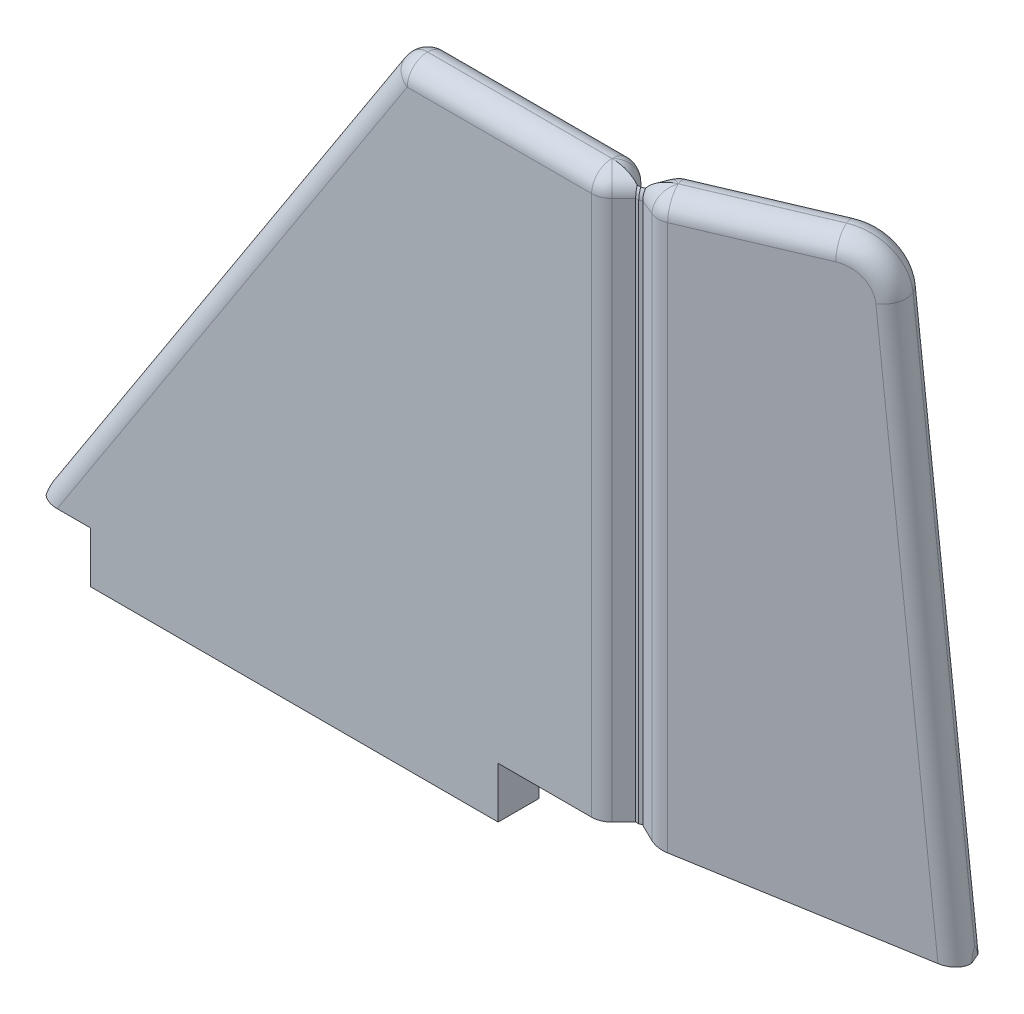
ISO-10303-21;
HEADER;
FILE_DESCRIPTION(('STEP AP214'),'2;1');
FILE_NAME('part.step','',(''),(''),'','','');
FILE_SCHEMA(('AUTOMOTIVE_DESIGN { 1 0 10303 214 1 1 1 1 }'));
ENDSEC;
DATA;
#1=APPLICATION_CONTEXT('core data for automotive mechanical design processes');
#2=APPLICATION_PROTOCOL_DEFINITION('international standard','automotive_design',2000,#1);
#3=PRODUCT_CONTEXT('',#1,'mechanical');
#4=PRODUCT('Part','Part','',(#3));
#5=PRODUCT_RELATED_PRODUCT_CATEGORY('part','',(#4));
#6=PRODUCT_DEFINITION_FORMATION('','',#4);
#7=PRODUCT_DEFINITION_CONTEXT('part definition',#1,'design');
#8=PRODUCT_DEFINITION('design','',#6,#7);
#9=PRODUCT_DEFINITION_SHAPE('','',#8);
#10=(LENGTH_UNIT() NAMED_UNIT(*) SI_UNIT(.MILLI.,.METRE.));
#11=(NAMED_UNIT(*) PLANE_ANGLE_UNIT() SI_UNIT($,.RADIAN.));
#12=(NAMED_UNIT(*) SI_UNIT($,.STERADIAN.) SOLID_ANGLE_UNIT());
#13=UNCERTAINTY_MEASURE_WITH_UNIT(LENGTH_MEASURE(1.E-05),#10,'distance_accuracy_value','');
#14=(GEOMETRIC_REPRESENTATION_CONTEXT(3) GLOBAL_UNCERTAINTY_ASSIGNED_CONTEXT((#13)) GLOBAL_UNIT_ASSIGNED_CONTEXT((#10,
#11,#12)) REPRESENTATION_CONTEXT('',''));
#15=CARTESIAN_POINT('',(0.,0.,0.));
#16=DIRECTION('',(0.,0.,1.));
#17=DIRECTION('',(1.,0.,0.));
#18=AXIS2_PLACEMENT_3D('',#15,#16,#17);
#19=CARTESIAN_POINT('',(22.9149385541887,60.,-9.998404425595));
#20=DIRECTION('',(0.,-1.,0.));
#21=DIRECTION('',(0.,0.,-1.));
#22=AXIS2_PLACEMENT_3D('',#19,#20,#21);
#23=PLANE('',#22);
#24=DIRECTION('',(1.,0.,0.));
#25=VECTOR('',#24,1.);
#26=CARTESIAN_POINT('',(22.9149385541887,60.,0.00999999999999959));
#27=LINE('',#26,#25);
#28=CARTESIAN_POINT('',(-20.9183759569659,60.,0.0100000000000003));
#29=VERTEX_POINT('',#28);
#30=CARTESIAN_POINT('',(-2.82428498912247,60.,0.01));
#31=VERTEX_POINT('',#30);
#32=EDGE_CURVE('E562',#29,#31,#27,.T.);
#33=ORIENTED_EDGE('',*,*,#32,.T.);
#34=DIRECTION('',(0.707106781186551,0.,-0.707106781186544));
#35=VECTOR('',#34,1.);
#36=CARTESIAN_POINT('',(15.0495289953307,60.,-17.863813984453));
#37=LINE('',#36,#35);
#38=CARTESIAN_POINT('',(-2.81428498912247,60.,0.));
#39=VERTEX_POINT('',#38);
#40=EDGE_CURVE('E564',#31,#39,#37,.T.);
#41=ORIENTED_EDGE('',*,*,#40,.T.);
#42=DIRECTION('',(-0.707106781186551,0.,-0.707106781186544));
#43=VECTOR('',#42,1.);
#44=CARTESIAN_POINT('',(5.05112456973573,60.,7.86540955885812));
#45=LINE('',#44,#43);
#46=CARTESIAN_POINT('',(-2.82428498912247,60.,-0.00999999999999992));
#47=VERTEX_POINT('',#46);
#48=EDGE_CURVE('E556',#39,#47,#45,.T.);
#49=ORIENTED_EDGE('',*,*,#48,.T.);
#50=DIRECTION('',(-1.,0.,0.));
#51=VECTOR('',#50,1.);
#52=CARTESIAN_POINT('',(22.9149385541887,60.,-0.00999999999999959));
#53=LINE('',#52,#51);
#54=CARTESIAN_POINT('',(-20.9183759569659,60.,-0.0100000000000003));
#55=VERTEX_POINT('',#54);
#56=EDGE_CURVE('E558',#47,#55,#53,.T.);
#57=ORIENTED_EDGE('',*,*,#56,.T.);
#58=DIRECTION('',(0.,0.,1.));
#59=VECTOR('',#58,1.);
#60=CARTESIAN_POINT('',(-20.9183759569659,60.,-9.998404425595));
#61=LINE('',#60,#59);
#62=EDGE_CURVE('E560',#55,#29,#61,.T.);
#63=ORIENTED_EDGE('',*,*,#62,.T.);
#64=EDGE_LOOP('',(#33,#41,#49,#57,#63));
#65=FACE_BOUND('',#64,.T.);
#66=ADVANCED_FACE('F36',(#65),#23,.F.);
#67=CARTESIAN_POINT('',(22.9149385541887,0.,-9.998404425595));
#68=DIRECTION('',(0.,-1.,0.));
#69=DIRECTION('',(0.,0.,-1.));
#70=AXIS2_PLACEMENT_3D('',#67,#68,#69);
#71=PLANE('',#70);
#72=DIRECTION('',(0.,0.,1.));
#73=VECTOR('',#72,1.);
#74=CARTESIAN_POINT('',(-52.,0.,-2.));
#75=LINE('',#74,#73);
#76=CARTESIAN_POINT('',(-52.,0.,-2.));
#77=VERTEX_POINT('',#76);
#78=CARTESIAN_POINT('',(-52.,0.,2.));
#79=VERTEX_POINT('',#78);
#80=EDGE_CURVE('E435',#77,#79,#75,.T.);
#81=ORIENTED_EDGE('',*,*,#80,.F.);
#82=DIRECTION('',(-1.,0.,0.));
#83=VECTOR('',#82,1.);
#84=CARTESIAN_POINT('',(-57.,0.,-2.));
#85=LINE('',#84,#83);
#86=CARTESIAN_POINT('',(-12.,0.,-2.));
#87=VERTEX_POINT('',#86);
#88=EDGE_CURVE('E482',#87,#77,#85,.T.);
#89=ORIENTED_EDGE('',*,*,#88,.F.);
#90=DIRECTION('',(0.,0.,1.));
#91=VECTOR('',#90,1.);
#92=CARTESIAN_POINT('',(-12.,0.,-2.));
#93=LINE('',#92,#91);
#94=CARTESIAN_POINT('',(-12.,0.,2.));
#95=VERTEX_POINT('',#94);
#96=EDGE_CURVE('E448',#87,#95,#93,.T.);
#97=ORIENTED_EDGE('',*,*,#96,.T.);
#98=DIRECTION('',(1.,0.,0.));
#99=VECTOR('',#98,1.);
#100=CARTESIAN_POINT('',(-2.00000000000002,0.,2.));
#101=LINE('',#100,#99);
#102=EDGE_CURVE('E485',#79,#95,#101,.T.);
#103=ORIENTED_EDGE('',*,*,#102,.F.);
#104=EDGE_LOOP('',(#81,#89,#97,#103));
#105=FACE_BOUND('',#104,.T.);
#106=ADVANCED_FACE('F701',(#105),#71,.T.);
#107=CARTESIAN_POINT('',(-0.0508630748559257,60.,-0.25));
#108=DIRECTION('',(0.390731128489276,0.,0.92050485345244));
#109=DIRECTION('',(0.92050485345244,0.,-0.390731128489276));
#110=AXIS2_PLACEMENT_3D('',#107,#108,#109);
#111=PLANE('',#110);
#112=DIRECTION('',(0.,-1.,0.));
#113=VECTOR('',#112,1.);
#114=CARTESIAN_POINT('',(-0.0508630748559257,60.,-0.25));
#115=LINE('',#114,#113);
#116=CARTESIAN_POINT('',(-0.0508630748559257,58.01,-0.25));
#117=VERTEX_POINT('',#116);
#118=CARTESIAN_POINT('',(-0.0508630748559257,5.,-0.25));
#119=VERTEX_POINT('',#118);
#120=EDGE_CURVE('E500',#117,#119,#115,.T.);
#121=ORIENTED_EDGE('',*,*,#120,.F.);
#122=DIRECTION('',(-0.92050485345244,0.,0.390731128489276));
#123=VECTOR('',#122,1.);
#124=CARTESIAN_POINT('',(-0.0508630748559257,58.01,-0.25));
#125=LINE('',#124,#123);
#126=CARTESIAN_POINT('',(0.132443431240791,58.01,-0.327808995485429));
#127=VERTEX_POINT('',#126);
#128=EDGE_CURVE('E309',#117,#127,#125,.F.);
#129=ORIENTED_EDGE('',*,*,#128,.T.);
#130=DIRECTION('',(0.,-1.,0.));
#131=VECTOR('',#130,1.);
#132=CARTESIAN_POINT('',(0.132443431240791,60.,-0.327808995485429));
#133=LINE('',#132,#131);
#134=CARTESIAN_POINT('',(0.132443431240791,5.,-0.32780899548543));
#135=VERTEX_POINT('',#134);
#136=EDGE_CURVE('E293',#127,#135,#133,.T.);
#137=ORIENTED_EDGE('',*,*,#136,.T.);
#138=DIRECTION('',(-0.92050485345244,0.,0.390731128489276));
#139=VECTOR('',#138,1.);
#140=CARTESIAN_POINT('',(-0.0508630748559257,5.,-0.25));
#141=LINE('',#140,#139);
#142=EDGE_CURVE('E465',#135,#119,#141,.T.);
#143=ORIENTED_EDGE('',*,*,#142,.T.);
#144=EDGE_LOOP('',(#121,#129,#137,#143));
#145=FACE_BOUND('',#144,.T.);
#146=ADVANCED_FACE('F674',(#145),#111,.F.);
#147=CARTESIAN_POINT('',(-0.25,60.,-0.25));
#148=DIRECTION('',(0.,0.,1.));
#149=DIRECTION('',(1.,0.,0.));
#150=AXIS2_PLACEMENT_3D('',#147,#148,#149);
#151=PLANE('',#150);
#152=DIRECTION('',(0.,-1.,0.));
#153=VECTOR('',#152,1.);
#154=CARTESIAN_POINT('',(-0.25,60.,-0.25));
#155=LINE('',#154,#153);
#156=CARTESIAN_POINT('',(-0.25,58.01,-0.25));
#157=VERTEX_POINT('',#156);
#158=CARTESIAN_POINT('',(-0.25,5.,-0.25));
#159=VERTEX_POINT('',#158);
#160=EDGE_CURVE('E498',#157,#159,#155,.T.);
#161=ORIENTED_EDGE('',*,*,#160,.F.);
#162=DIRECTION('',(-1.,0.,0.));
#163=VECTOR('',#162,1.);
#164=CARTESIAN_POINT('',(-0.25,58.01,-0.25));
#165=LINE('',#164,#163);
#166=EDGE_CURVE('E601',#157,#117,#165,.F.);
#167=ORIENTED_EDGE('',*,*,#166,.T.);
#168=ORIENTED_EDGE('',*,*,#120,.T.);
#169=DIRECTION('',(-1.,0.,0.));
#170=VECTOR('',#169,1.);
#171=CARTESIAN_POINT('',(-0.25,5.,-0.25));
#172=LINE('',#171,#170);
#173=EDGE_CURVE('E468',#119,#159,#172,.T.);
#174=ORIENTED_EDGE('',*,*,#173,.T.);
#175=EDGE_LOOP('',(#161,#167,#168,#174));
#176=FACE_BOUND('',#175,.T.);
#177=ADVANCED_FACE('F758',(#176),#151,.F.);
#178=CARTESIAN_POINT('',(-0.25,60.,-0.25));
#179=DIRECTION('',(-0.707106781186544,0.,0.707106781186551));
#180=DIRECTION('',(0.707106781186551,0.,0.707106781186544));
#181=AXIS2_PLACEMENT_3D('',#178,#179,#180);
#182=PLANE('',#181);
#183=DIRECTION('',(0.,-1.,0.));
#184=VECTOR('',#183,1.);
#185=CARTESIAN_POINT('',(-1.41714249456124,60.,-1.41714249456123));
#186=LINE('',#185,#184);
#187=CARTESIAN_POINT('',(-1.41714249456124,5.,-1.41714249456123));
#188=VERTEX_POINT('',#187);
#189=CARTESIAN_POINT('',(-1.41714249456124,58.01,-1.41714249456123));
#190=VERTEX_POINT('',#189);
#191=EDGE_CURVE('E597',#188,#190,#186,.F.);
#192=ORIENTED_EDGE('',*,*,#191,.T.);
#193=DIRECTION('',(-0.707106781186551,0.,-0.707106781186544));
#194=VECTOR('',#193,1.);
#195=CARTESIAN_POINT('',(-0.25,58.01,-0.25));
#196=LINE('',#195,#194);
#197=EDGE_CURVE('E599',#190,#157,#196,.F.);
#198=ORIENTED_EDGE('',*,*,#197,.T.);
#199=ORIENTED_EDGE('',*,*,#160,.T.);
#200=DIRECTION('',(-0.707106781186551,0.,-0.707106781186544));
#201=VECTOR('',#200,1.);
#202=CARTESIAN_POINT('',(-0.25,5.,-0.25));
#203=LINE('',#202,#201);
#204=EDGE_CURVE('E471',#159,#188,#203,.T.);
#205=ORIENTED_EDGE('',*,*,#204,.T.);
#206=EDGE_LOOP('',(#192,#198,#199,#205));
#207=FACE_BOUND('',#206,.T.);
#208=ADVANCED_FACE('F754',(#207),#182,.F.);
#209=CARTESIAN_POINT('',(-57.,60.,-2.));
#210=DIRECTION('',(0.,0.,1.));
#211=DIRECTION('',(1.,0.,0.));
#212=AXIS2_PLACEMENT_3D('',#209,#210,#211);
#213=PLANE('',#212);
#214=DIRECTION('',(-1.,0.,0.));
#215=VECTOR('',#214,1.);
#216=CARTESIAN_POINT('',(-57.,58.01,-2.));
#217=LINE('',#216,#215);
#218=CARTESIAN_POINT('',(-20.9183759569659,58.01,-2.));
#219=VERTEX_POINT('',#218);
#220=CARTESIAN_POINT('',(-2.82428498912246,58.01,-2.));
#221=VERTEX_POINT('',#220);
#222=EDGE_CURVE('E593',#219,#221,#217,.F.);
#223=ORIENTED_EDGE('',*,*,#222,.T.);
#224=DIRECTION('',(0.,-1.,0.));
#225=VECTOR('',#224,1.);
#226=CARTESIAN_POINT('',(-2.82428498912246,60.,-2.));
#227=LINE('',#226,#225);
#228=CARTESIAN_POINT('',(-2.82428498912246,5.,-2.));
#229=VERTEX_POINT('',#228);
#230=EDGE_CURVE('E595',#221,#229,#227,.T.);
#231=ORIENTED_EDGE('',*,*,#230,.T.);
#232=DIRECTION('',(-1.,0.,0.));
#233=VECTOR('',#232,1.);
#234=CARTESIAN_POINT('',(-12.,5.,-2.));
#235=LINE('',#234,#233);
#236=CARTESIAN_POINT('',(-12.,5.,-2.));
#237=VERTEX_POINT('',#236);
#238=EDGE_CURVE('E445',#229,#237,#235,.T.);
#239=ORIENTED_EDGE('',*,*,#238,.T.);
#240=DIRECTION('',(0.,-1.,0.));
#241=VECTOR('',#240,1.);
#242=CARTESIAN_POINT('',(-12.,0.,-2.));
#243=LINE('',#242,#241);
#244=EDGE_CURVE('E442',#237,#87,#243,.T.);
#245=ORIENTED_EDGE('',*,*,#244,.T.);
#246=ORIENTED_EDGE('',*,*,#88,.T.);
#247=DIRECTION('',(0.,1.,0.));
#248=VECTOR('',#247,1.);
#249=CARTESIAN_POINT('',(-52.,0.,-2.));
#250=LINE('',#249,#248);
#251=CARTESIAN_POINT('',(-52.,5.,-2.));
#252=VERTEX_POINT('',#251);
#253=EDGE_CURVE('E425',#77,#252,#250,.T.);
#254=ORIENTED_EDGE('',*,*,#253,.T.);
#255=DIRECTION('',(-1.,0.,0.));
#256=VECTOR('',#255,1.);
#257=CARTESIAN_POINT('',(-52.,5.,-2.));
#258=LINE('',#257,#256);
#259=CARTESIAN_POINT('',(-55.2767092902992,5.,-2.));
#260=VERTEX_POINT('',#259);
#261=EDGE_CURVE('E428',#252,#260,#258,.T.);
#262=ORIENTED_EDGE('',*,*,#261,.T.);
#263=DIRECTION('',(0.543895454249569,0.839152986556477,0.));
#264=VECTOR('',#263,1.);
#265=CARTESIAN_POINT('',(-30.6838648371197,42.9432457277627,-2.));
#266=LINE('',#265,#264);
#267=EDGE_CURVE('E591',#260,#219,#266,.T.);
#268=ORIENTED_EDGE('',*,*,#267,.T.);
#269=EDGE_LOOP('',(#223,#231,#239,#245,#246,#254,#262,#268));
#270=FACE_BOUND('',#269,.T.);
#271=ADVANCED_FACE('F750',(#270),#213,.F.);
#272=CARTESIAN_POINT('',(-57.,60.,2.));
#273=DIRECTION('',(1.,0.,0.));
#274=DIRECTION('',(0.,0.,-1.));
#275=AXIS2_PLACEMENT_3D('',#272,#273,#274);
#276=PLANE('',#275);
#277=DIRECTION('',(0.,0.,1.));
#278=VECTOR('',#277,1.);
#279=CARTESIAN_POINT('',(-57.,6.,-2.));
#280=LINE('',#279,#278);
#281=CARTESIAN_POINT('',(-57.,6.,-0.0100000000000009));
#282=VERTEX_POINT('',#281);
#283=CARTESIAN_POINT('',(-57.,6.,0.0100000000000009));
#284=VERTEX_POINT('',#283);
#285=EDGE_CURVE('E421',#282,#284,#280,.T.);
#286=ORIENTED_EDGE('',*,*,#285,.F.);
#287=CARTESIAN_POINT('',(-57.,2.34120861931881,-0.0100000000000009));
#288=DIRECTION('',(1.,0.,0.));
#289=DIRECTION('',(0.,1.,0.));
#290=AXIS2_PLACEMENT_3D('',#287,#288,#289);
#291=ELLIPSE('',#290,3.65879138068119,1.99);
#292=CARTESIAN_POINT('',(-57.,5.,-1.37707046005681));
#293=VERTEX_POINT('',#292);
#294=EDGE_CURVE('E609',#282,#293,#291,.F.);
#295=ORIENTED_EDGE('',*,*,#294,.T.);
#296=DIRECTION('',(0.,0.,1.));
#297=VECTOR('',#296,1.);
#298=CARTESIAN_POINT('',(-57.,5.,-2.));
#299=LINE('',#298,#297);
#300=CARTESIAN_POINT('',(-57.,5.,1.37707046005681));
#301=VERTEX_POINT('',#300);
#302=EDGE_CURVE('E438',#293,#301,#299,.T.);
#303=ORIENTED_EDGE('',*,*,#302,.T.);
#304=CARTESIAN_POINT('',(-57.,2.34120861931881,0.0100000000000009));
#305=DIRECTION('',(1.,0.,0.));
#306=DIRECTION('',(0.,1.,0.));
#307=AXIS2_PLACEMENT_3D('',#304,#305,#306);
#308=ELLIPSE('',#307,3.65879138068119,1.99);
#309=EDGE_CURVE('E607',#301,#284,#308,.F.);
#310=ORIENTED_EDGE('',*,*,#309,.T.);
#311=EDGE_LOOP('',(#286,#295,#303,#310));
#312=FACE_BOUND('',#311,.T.);
#313=ADVANCED_FACE('F746',(#312),#276,.F.);
#314=CARTESIAN_POINT('',(-2.00000000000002,60.,2.));
#315=DIRECTION('',(0.,0.,-1.));
#316=DIRECTION('',(-1.,0.,0.));
#317=AXIS2_PLACEMENT_3D('',#314,#315,#316);
#318=PLANE('',#317);
#319=DIRECTION('',(-1.,0.,0.));
#320=VECTOR('',#319,1.);
#321=CARTESIAN_POINT('',(-12.,5.,2.));
#322=LINE('',#321,#320);
#323=CARTESIAN_POINT('',(-2.82428498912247,5.,2.));
#324=VERTEX_POINT('',#323);
#325=CARTESIAN_POINT('',(-12.,5.,2.));
#326=VERTEX_POINT('',#325);
#327=EDGE_CURVE('E446',#324,#326,#322,.T.);
#328=ORIENTED_EDGE('',*,*,#327,.F.);
#329=DIRECTION('',(0.,-1.,0.));
#330=VECTOR('',#329,1.);
#331=CARTESIAN_POINT('',(-2.82428498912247,60.,2.));
#332=LINE('',#331,#330);
#333=CARTESIAN_POINT('',(-2.82428498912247,58.01,2.));
#334=VERTEX_POINT('',#333);
#335=EDGE_CURVE('E583',#324,#334,#332,.F.);
#336=ORIENTED_EDGE('',*,*,#335,.T.);
#337=DIRECTION('',(1.,0.,0.));
#338=VECTOR('',#337,1.);
#339=CARTESIAN_POINT('',(-2.00000000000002,58.01,2.));
#340=LINE('',#339,#338);
#341=CARTESIAN_POINT('',(-20.9183759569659,58.01,2.));
#342=VERTEX_POINT('',#341);
#343=EDGE_CURVE('E581',#334,#342,#340,.F.);
#344=ORIENTED_EDGE('',*,*,#343,.T.);
#345=DIRECTION('',(0.543895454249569,0.839152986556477,0.));
#346=VECTOR('',#345,1.);
#347=CARTESIAN_POINT('',(-14.4136402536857,68.0458779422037,2.));
#348=LINE('',#347,#346);
#349=CARTESIAN_POINT('',(-55.2767092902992,5.,2.));
#350=VERTEX_POINT('',#349);
#351=EDGE_CURVE('E579',#342,#350,#348,.F.);
#352=ORIENTED_EDGE('',*,*,#351,.T.);
#353=DIRECTION('',(-1.,0.,0.));
#354=VECTOR('',#353,1.);
#355=CARTESIAN_POINT('',(-52.,5.,2.));
#356=LINE('',#355,#354);
#357=CARTESIAN_POINT('',(-52.,5.,2.));
#358=VERTEX_POINT('',#357);
#359=EDGE_CURVE('E429',#358,#350,#356,.T.);
#360=ORIENTED_EDGE('',*,*,#359,.F.);
#361=DIRECTION('',(0.,1.,0.));
#362=VECTOR('',#361,1.);
#363=CARTESIAN_POINT('',(-52.,0.,2.));
#364=LINE('',#363,#362);
#365=EDGE_CURVE('E424',#79,#358,#364,.T.);
#366=ORIENTED_EDGE('',*,*,#365,.F.);
#367=ORIENTED_EDGE('',*,*,#102,.T.);
#368=DIRECTION('',(0.,-1.,0.));
#369=VECTOR('',#368,1.);
#370=CARTESIAN_POINT('',(-12.,0.,2.));
#371=LINE('',#370,#369);
#372=EDGE_CURVE('E437',#326,#95,#371,.T.);
#373=ORIENTED_EDGE('',*,*,#372,.F.);
#374=EDGE_LOOP('',(#328,#336,#344,#352,#360,#366,#367,#373));
#375=FACE_BOUND('',#374,.T.);
#376=ADVANCED_FACE('F742',(#375),#318,.F.);
#377=CARTESIAN_POINT('',(-0.25,60.,0.25));
#378=DIRECTION('',(-0.707106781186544,0.,-0.707106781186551));
#379=DIRECTION('',(-0.707106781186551,0.,0.707106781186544));
#380=AXIS2_PLACEMENT_3D('',#377,#378,#379);
#381=PLANE('',#380);
#382=DIRECTION('',(0.,-1.,0.));
#383=VECTOR('',#382,1.);
#384=CARTESIAN_POINT('',(-0.25,60.,0.25));
#385=LINE('',#384,#383);
#386=CARTESIAN_POINT('',(-0.25,58.01,0.25));
#387=VERTEX_POINT('',#386);
#388=CARTESIAN_POINT('',(-0.25,5.,0.25));
#389=VERTEX_POINT('',#388);
#390=EDGE_CURVE('E495',#387,#389,#385,.T.);
#391=ORIENTED_EDGE('',*,*,#390,.F.);
#392=DIRECTION('',(0.707106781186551,0.,-0.707106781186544));
#393=VECTOR('',#392,1.);
#394=CARTESIAN_POINT('',(-0.25,58.01,0.25));
#395=LINE('',#394,#393);
#396=CARTESIAN_POINT('',(-1.41714249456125,58.01,1.41714249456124));
#397=VERTEX_POINT('',#396);
#398=EDGE_CURVE('E577',#387,#397,#395,.F.);
#399=ORIENTED_EDGE('',*,*,#398,.T.);
#400=DIRECTION('',(0.,-1.,0.));
#401=VECTOR('',#400,1.);
#402=CARTESIAN_POINT('',(-1.41714249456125,60.,1.41714249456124));
#403=LINE('',#402,#401);
#404=CARTESIAN_POINT('',(-1.41714249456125,5.,1.41714249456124));
#405=VERTEX_POINT('',#404);
#406=EDGE_CURVE('E575',#397,#405,#403,.T.);
#407=ORIENTED_EDGE('',*,*,#406,.T.);
#408=DIRECTION('',(0.707106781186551,0.,-0.707106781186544));
#409=VECTOR('',#408,1.);
#410=CARTESIAN_POINT('',(-0.25,5.,0.25));
#411=LINE('',#410,#409);
#412=EDGE_CURVE('E480',#405,#389,#411,.T.);
#413=ORIENTED_EDGE('',*,*,#412,.T.);
#414=EDGE_LOOP('',(#391,#399,#407,#413));
#415=FACE_BOUND('',#414,.T.);
#416=ADVANCED_FACE('F738',(#415),#381,.F.);
#417=CARTESIAN_POINT('',(-0.25,60.,0.25));
#418=DIRECTION('',(0.,0.,-1.));
#419=DIRECTION('',(-1.,0.,0.));
#420=AXIS2_PLACEMENT_3D('',#417,#418,#419);
#421=PLANE('',#420);
#422=DIRECTION('',(0.,-1.,0.));
#423=VECTOR('',#422,1.);
#424=CARTESIAN_POINT('',(0.0508630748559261,60.,0.25));
#425=LINE('',#424,#423);
#426=CARTESIAN_POINT('',(0.0508630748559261,58.01,0.25));
#427=VERTEX_POINT('',#426);
#428=CARTESIAN_POINT('',(0.0508630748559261,5.,0.25));
#429=VERTEX_POINT('',#428);
#430=EDGE_CURVE('E493',#427,#429,#425,.T.);
#431=ORIENTED_EDGE('',*,*,#430,.F.);
#432=DIRECTION('',(1.,0.,0.));
#433=VECTOR('',#432,1.);
#434=CARTESIAN_POINT('',(-0.25,58.01,0.25));
#435=LINE('',#434,#433);
#436=EDGE_CURVE('E573',#427,#387,#435,.F.);
#437=ORIENTED_EDGE('',*,*,#436,.T.);
#438=ORIENTED_EDGE('',*,*,#390,.T.);
#439=DIRECTION('',(1.,0.,0.));
#440=VECTOR('',#439,1.);
#441=CARTESIAN_POINT('',(-0.25,5.,0.25));
#442=LINE('',#441,#440);
#443=EDGE_CURVE('E477',#389,#429,#442,.T.);
#444=ORIENTED_EDGE('',*,*,#443,.T.);
#445=EDGE_LOOP('',(#431,#437,#438,#444));
#446=FACE_BOUND('',#445,.T.);
#447=ADVANCED_FACE('F734',(#446),#421,.F.);
#448=CARTESIAN_POINT('',(0.327808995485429,60.,0.132443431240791));
#449=DIRECTION('',(-0.390731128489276,0.,-0.92050485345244));
#450=DIRECTION('',(-0.92050485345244,0.,0.390731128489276));
#451=AXIS2_PLACEMENT_3D('',#448,#449,#450);
#452=PLANE('',#451);
#453=DIRECTION('',(0.,-1.,0.));
#454=VECTOR('',#453,1.);
#455=CARTESIAN_POINT('',(0.327808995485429,60.,0.132443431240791));
#456=LINE('',#455,#454);
#457=CARTESIAN_POINT('',(0.327808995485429,58.01,0.132443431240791));
#458=VERTEX_POINT('',#457);
#459=CARTESIAN_POINT('',(0.327808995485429,5.,0.132443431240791));
#460=VERTEX_POINT('',#459);
#461=EDGE_CURVE('E491',#458,#460,#456,.T.);
#462=ORIENTED_EDGE('',*,*,#461,.F.);
#463=DIRECTION('',(0.92050485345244,0.,-0.390731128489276));
#464=VECTOR('',#463,1.);
#465=CARTESIAN_POINT('',(0.327808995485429,58.01,0.132443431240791));
#466=LINE('',#465,#464);
#467=EDGE_CURVE('E571',#458,#427,#466,.F.);
#468=ORIENTED_EDGE('',*,*,#467,.T.);
#469=ORIENTED_EDGE('',*,*,#430,.T.);
#470=DIRECTION('',(0.92050485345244,0.,-0.390731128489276));
#471=VECTOR('',#470,1.);
#472=CARTESIAN_POINT('',(0.327808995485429,5.,0.132443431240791));
#473=LINE('',#472,#471);
#474=EDGE_CURVE('E474',#429,#460,#473,.T.);
#475=ORIENTED_EDGE('',*,*,#474,.T.);
#476=EDGE_LOOP('',(#462,#468,#469,#475));
#477=FACE_BOUND('',#476,.T.);
#478=ADVANCED_FACE('F731',(#477),#452,.F.);
#479=CARTESIAN_POINT('',(2.62247196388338,60.,1.05954744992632));
#480=DIRECTION('',(0.374606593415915,0.,-0.927183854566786));
#481=DIRECTION('',(-0.927183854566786,0.,-0.374606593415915));
#482=AXIS2_PLACEMENT_3D('',#479,#480,#481);
#483=PLANE('',#482);
#484=DIRECTION('',(0.,-1.,0.));
#485=VECTOR('',#484,1.);
#486=CARTESIAN_POINT('',(1.85820823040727,60.,0.750764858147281));
#487=LINE('',#486,#485);
#488=CARTESIAN_POINT('',(1.85820823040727,4.71657150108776,0.750764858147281));
#489=VERTEX_POINT('',#488);
#490=CARTESIAN_POINT('',(1.85820823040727,58.01,0.750764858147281));
#491=VERTEX_POINT('',#490);
#492=EDGE_CURVE('E567',#489,#491,#487,.F.);
#493=ORIENTED_EDGE('',*,*,#492,.T.);
#494=DIRECTION('',(0.927183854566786,0.,0.374606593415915));
#495=VECTOR('',#494,1.);
#496=CARTESIAN_POINT('',(2.62247196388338,58.01,1.05954744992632));
#497=LINE('',#496,#495);
#498=EDGE_CURVE('E569',#491,#458,#497,.F.);
#499=ORIENTED_EDGE('',*,*,#498,.T.);
#500=ORIENTED_EDGE('',*,*,#461,.T.);
#501=DIRECTION('',(0.,-1.,0.));
#502=VECTOR('',#501,1.);
#503=CARTESIAN_POINT('',(0.327808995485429,60.,0.132443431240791));
#504=LINE('',#503,#502);
#505=CARTESIAN_POINT('',(0.327808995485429,4.95,0.132443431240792));
#506=VERTEX_POINT('',#505);
#507=EDGE_CURVE('E462',#460,#506,#504,.T.);
#508=ORIENTED_EDGE('',*,*,#507,.T.);
#509=DIRECTION('',(0.918048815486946,-0.1400280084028,0.370915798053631));
#510=VECTOR('',#509,1.);
#511=CARTESIAN_POINT('',(-4.49933915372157,5.68627450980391,-1.81785101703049));
#512=LINE('',#511,#510);
#513=EDGE_CURVE('E418',#506,#489,#512,.T.);
#514=ORIENTED_EDGE('',*,*,#513,.T.);
#515=EDGE_LOOP('',(#493,#499,#500,#508,#514));
#516=FACE_BOUND('',#515,.T.);
#517=ADVANCED_FACE('F656',(#516),#483,.F.);
#518=CARTESIAN_POINT('',(23.7940835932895,60.,-7.92726850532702));
#519=DIRECTION('',(-0.390731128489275,0.,-0.92050485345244));
#520=DIRECTION('',(-0.92050485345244,0.,0.390731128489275));
#521=AXIS2_PLACEMENT_3D('',#518,#519,#520);
#522=PLANE('',#521);
#523=DIRECTION('',(0.92050485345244,0.,-0.390731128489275));
#524=VECTOR('',#523,1.);
#525=CARTESIAN_POINT('',(23.7940835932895,58.01,-7.92726850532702));
#526=LINE('',#525,#524);
#527=CARTESIAN_POINT('',(14.962581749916,58.01,-4.17851838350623));
#528=VERTEX_POINT('',#527);
#529=CARTESIAN_POINT('',(3.3812302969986,58.01,0.737473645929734));
#530=VERTEX_POINT('',#529);
#531=EDGE_CURVE('E545',#528,#530,#526,.F.);
#532=ORIENTED_EDGE('',*,*,#531,.T.);
#533=DIRECTION('',(0.,-1.,0.));
#534=VECTOR('',#533,1.);
#535=CARTESIAN_POINT('',(3.3812302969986,60.,0.737473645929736));
#536=LINE('',#535,#534);
#537=CARTESIAN_POINT('',(3.3812302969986,4.43514300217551,0.737473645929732));
#538=VERTEX_POINT('',#537);
#539=EDGE_CURVE('E547',#530,#538,#536,.T.);
#540=ORIENTED_EDGE('',*,*,#539,.T.);
#541=DIRECTION('',(-0.902629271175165,0.196116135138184,0.383143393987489));
#542=VECTOR('',#541,1.);
#543=CARTESIAN_POINT('',(0.78146225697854,5.,1.84100970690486));
#544=LINE('',#543,#542);
#545=CARTESIAN_POINT('',(22.0033706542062,0.389071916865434,-7.16715595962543));
#546=VERTEX_POINT('',#545);
#547=EDGE_CURVE('E406',#546,#538,#544,.T.);
#548=ORIENTED_EDGE('',*,*,#547,.F.);
#549=DIRECTION('',(0.0777302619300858,-0.996428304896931,-0.0329945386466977));
#550=VECTOR('',#549,1.);
#551=CARTESIAN_POINT('',(17.3991162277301,59.411250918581,-5.21276590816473));
#552=LINE('',#551,#550);
#553=CARTESIAN_POINT('',(17.7234051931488,55.2541736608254,-5.35041840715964));
#554=VERTEX_POINT('',#553);
#555=EDGE_CURVE('E541',#546,#554,#552,.F.);
#556=ORIENTED_EDGE('',*,*,#555,.T.);
#557=CARTESIAN_POINT('',(14.962581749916,55.,-4.17851838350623));
#558=DIRECTION('',(-0.390731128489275,0.,-0.92050485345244));
#559=DIRECTION('',(-0.92050485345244,0.,0.390731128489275));
#560=AXIS2_PLACEMENT_3D('',#557,#558,#559);
#561=CIRCLE('',#560,3.01);
#562=EDGE_CURVE('E543',#554,#528,#561,.F.);
#563=ORIENTED_EDGE('',*,*,#562,.T.);
#564=EDGE_LOOP('',(#532,#540,#548,#556,#563));
#565=FACE_BOUND('',#564,.T.);
#566=ADVANCED_FACE('F644',(#565),#522,.F.);
#567=CARTESIAN_POINT('',(22.2311590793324,60.,-11.6092879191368));
#568=DIRECTION('',(-0.920504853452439,0.,0.390731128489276));
#569=DIRECTION('',(0.390731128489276,0.,0.920504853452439));
#570=AXIS2_PLACEMENT_3D('',#567,#568,#569);
#571=PLANE('',#570);
#572=DIRECTION('',(-0.390731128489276,0.,-0.920504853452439));
#573=VECTOR('',#572,1.);
#574=CARTESIAN_POINT('',(22.2311590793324,0.,-11.6092879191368));
#575=LINE('',#574,#573);
#576=CARTESIAN_POINT('',(23.2406301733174,0.,-9.23112305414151));
#577=VERTEX_POINT('',#576);
#578=CARTESIAN_POINT('',(22.7846124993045,0.,-10.3054333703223));
#579=VERTEX_POINT('',#578);
#580=EDGE_CURVE('E487',#577,#579,#575,.T.);
#581=ORIENTED_EDGE('',*,*,#580,.T.);
#582=CARTESIAN_POINT('',(23.0087140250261,-22.5661711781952,-9.77748326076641));
#583=DIRECTION('',(-0.920504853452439,0.,0.390731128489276));
#584=DIRECTION('',(0.,-1.,0.));
#585=AXIS2_PLACEMENT_3D('',#582,#583,#584);
#586=ELLIPSE('',#585,23.5661711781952,1.99);
#587=CARTESIAN_POINT('',(23.0087140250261,1.,-9.7774832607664));
#588=VERTEX_POINT('',#587);
#589=EDGE_CURVE('E531',#579,#588,#586,.F.);
#590=ORIENTED_EDGE('',*,*,#589,.T.);
#591=DIRECTION('',(0.390731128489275,0.,0.92050485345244));
#592=VECTOR('',#591,1.);
#593=CARTESIAN_POINT('',(22.2311590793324,1.,-11.6092879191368));
#594=LINE('',#593,#592);
#595=CARTESIAN_POINT('',(23.0165286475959,1.,-9.75907316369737));
#596=VERTEX_POINT('',#595);
#597=EDGE_CURVE('E402',#588,#596,#594,.T.);
#598=ORIENTED_EDGE('',*,*,#597,.T.);
#599=CARTESIAN_POINT('',(23.0165286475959,-22.5661711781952,-9.75907316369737));
#600=DIRECTION('',(-0.920504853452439,0.,0.390731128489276));
#601=DIRECTION('',(0.,-1.,0.));
#602=AXIS2_PLACEMENT_3D('',#599,#600,#601);
#603=ELLIPSE('',#602,23.5661711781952,1.99);
#604=EDGE_CURVE('E529',#596,#577,#603,.F.);
#605=ORIENTED_EDGE('',*,*,#604,.T.);
#606=EDGE_LOOP('',(#581,#590,#598,#605));
#607=FACE_BOUND('',#606,.T.);
#608=ADVANCED_FACE('F721',(#607),#571,.F.);
#609=CARTESIAN_POINT('',(1.0595474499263,60.,-2.62247196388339));
#610=DIRECTION('',(0.390731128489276,0.,0.920504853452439));
#611=DIRECTION('',(0.920504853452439,0.,-0.390731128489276));
#612=AXIS2_PLACEMENT_3D('',#609,#610,#611);
#613=PLANE('',#612);
#614=CARTESIAN_POINT('',(13.3996572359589,55.,-7.86053779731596));
#615=DIRECTION('',(0.390731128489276,0.,0.920504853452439));
#616=DIRECTION('',(0.920504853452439,0.,-0.390731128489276));
#617=AXIS2_PLACEMENT_3D('',#614,#615,#616);
#618=CIRCLE('',#617,3.01);
#619=CARTESIAN_POINT('',(13.3996572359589,58.01,-7.86053779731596));
#620=VERTEX_POINT('',#619);
#621=CARTESIAN_POINT('',(16.1604806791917,55.2541736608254,-9.03243782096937));
#622=VERTEX_POINT('',#621);
#623=EDGE_CURVE('E517',#620,#622,#618,.F.);
#624=ORIENTED_EDGE('',*,*,#623,.T.);
#625=DIRECTION('',(0.0777302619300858,-0.996428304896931,-0.0329945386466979));
#626=VECTOR('',#625,1.);
#627=CARTESIAN_POINT('',(15.685224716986,61.346504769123,-8.8307036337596));
#628=LINE('',#627,#626);
#629=CARTESIAN_POINT('',(20.4404461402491,0.389071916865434,-10.8491753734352));
#630=VERTEX_POINT('',#629);
#631=EDGE_CURVE('E519',#622,#630,#628,.T.);
#632=ORIENTED_EDGE('',*,*,#631,.T.);
#633=DIRECTION('',(-0.902629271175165,0.196116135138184,0.383143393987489));
#634=VECTOR('',#633,1.);
#635=CARTESIAN_POINT('',(-0.78146225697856,5.,-1.8410097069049));
#636=LINE('',#635,#634);
#637=CARTESIAN_POINT('',(1.8183057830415,4.43514300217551,-2.94454576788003));
#638=VERTEX_POINT('',#637);
#639=EDGE_CURVE('E412',#630,#638,#636,.T.);
#640=ORIENTED_EDGE('',*,*,#639,.T.);
#641=DIRECTION('',(0.,-1.,0.));
#642=VECTOR('',#641,1.);
#643=CARTESIAN_POINT('',(1.81830578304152,60.,-2.94454576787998));
#644=LINE('',#643,#642);
#645=CARTESIAN_POINT('',(1.81830578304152,58.01,-2.94454576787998));
#646=VERTEX_POINT('',#645);
#647=EDGE_CURVE('E513',#638,#646,#644,.F.);
#648=ORIENTED_EDGE('',*,*,#647,.T.);
#649=DIRECTION('',(-0.920504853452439,0.,0.390731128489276));
#650=VECTOR('',#649,1.);
#651=CARTESIAN_POINT('',(1.0595474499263,58.01,-2.62247196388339));
#652=LINE('',#651,#650);
#653=EDGE_CURVE('E515',#646,#620,#652,.F.);
#654=ORIENTED_EDGE('',*,*,#653,.T.);
#655=EDGE_LOOP('',(#624,#632,#640,#648,#654));
#656=FACE_BOUND('',#655,.T.);
#657=ADVANCED_FACE('F716',(#656),#613,.F.);
#658=CARTESIAN_POINT('',(1.0595474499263,60.,-2.62247196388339));
#659=DIRECTION('',(0.92718385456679,0.,0.374606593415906));
#660=DIRECTION('',(0.374606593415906,0.,-0.92718385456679));
#661=AXIS2_PLACEMENT_3D('',#658,#659,#660);
#662=PLANE('',#661);
#663=ORIENTED_EDGE('',*,*,#136,.F.);
#664=DIRECTION('',(-0.374606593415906,0.,0.92718385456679));
#665=VECTOR('',#664,1.);
#666=CARTESIAN_POINT('',(1.0595474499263,58.01,-2.62247196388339));
#667=LINE('',#666,#665);
#668=CARTESIAN_POINT('',(0.750764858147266,58.01,-1.85820823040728));
#669=VERTEX_POINT('',#668);
#670=EDGE_CURVE('E288',#127,#669,#667,.F.);
#671=ORIENTED_EDGE('',*,*,#670,.T.);
#672=DIRECTION('',(0.,-1.,0.));
#673=VECTOR('',#672,1.);
#674=CARTESIAN_POINT('',(0.750764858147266,60.,-1.85820823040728));
#675=LINE('',#674,#673);
#676=CARTESIAN_POINT('',(0.750764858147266,4.71657150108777,-1.85820823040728));
#677=VERTEX_POINT('',#676);
#678=EDGE_CURVE('E291',#669,#677,#675,.T.);
#679=ORIENTED_EDGE('',*,*,#678,.T.);
#680=DIRECTION('',(-0.370915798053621,0.1400280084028,0.918048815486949));
#681=VECTOR('',#680,1.);
#682=CARTESIAN_POINT('',(-1.81785101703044,5.68627450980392,4.49933915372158));
#683=LINE('',#682,#681);
#684=CARTESIAN_POINT('',(0.327808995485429,4.87624565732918,-0.811355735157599));
#685=VERTEX_POINT('',#684);
#686=EDGE_CURVE('E86',#677,#685,#683,.T.);
#687=ORIENTED_EDGE('',*,*,#686,.T.);
#688=DIRECTION('',(0.,1.,0.));
#689=VECTOR('',#688,1.);
#690=CARTESIAN_POINT('',(0.327808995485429,60.,-0.811355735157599));
#691=LINE('',#690,#689);
#692=CARTESIAN_POINT('',(0.327808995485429,5.,-0.811355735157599));
#693=VERTEX_POINT('',#692);
#694=EDGE_CURVE('E455',#685,#693,#691,.T.);
#695=ORIENTED_EDGE('',*,*,#694,.T.);
#696=DIRECTION('',(-0.374606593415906,0.,0.92718385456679));
#697=VECTOR('',#696,1.);
#698=CARTESIAN_POINT('',(1.0595474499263,5.,-2.62247196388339));
#699=LINE('',#698,#697);
#700=EDGE_CURVE('E502',#693,#135,#699,.T.);
#701=ORIENTED_EDGE('',*,*,#700,.T.);
#702=EDGE_LOOP('',(#663,#671,#679,#687,#695,#701));
#703=FACE_BOUND('',#702,.T.);
#704=ADVANCED_FACE('F290',(#703),#662,.F.);
#705=DIRECTION('',(0.390731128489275,0.,0.92050485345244));
#706=VECTOR('',#705,1.);
#707=CARTESIAN_POINT('',(14.0834367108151,60.,-6.24965430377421));
#708=LINE('',#707,#706);
#709=CARTESIAN_POINT('',(14.1850268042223,60.,-6.01032304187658));
#710=VERTEX_POINT('',#709);
#711=CARTESIAN_POINT('',(14.1772121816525,60.,-6.02873313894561));
#712=VERTEX_POINT('',#711);
#713=EDGE_CURVE('E510',#710,#712,#708,.F.);
#714=ORIENTED_EDGE('',*,*,#713,.T.);
#715=DIRECTION('',(-0.920504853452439,0.,0.390731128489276));
#716=VECTOR('',#715,1.);
#717=CARTESIAN_POINT('',(23.0087140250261,60.,-9.77748326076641));
#718=LINE('',#717,#716);
#719=CARTESIAN_POINT('',(2.59586072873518,60.,-1.11274110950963));
#720=VERTEX_POINT('',#719);
#721=EDGE_CURVE('E554',#712,#720,#718,.T.);
#722=ORIENTED_EDGE('',*,*,#721,.T.);
#723=DIRECTION('',(-0.374606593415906,0.,0.92718385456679));
#724=VECTOR('',#723,1.);
#725=CARTESIAN_POINT('',(8.53348914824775,60.,-15.8088871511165));
#726=LINE('',#725,#724);
#727=CARTESIAN_POINT('',(2.59056299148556,60.,-1.09962874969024));
#728=VERTEX_POINT('',#727);
#729=EDGE_CURVE('E316',#720,#728,#726,.T.);
#730=ORIENTED_EDGE('',*,*,#729,.T.);
#731=DIRECTION('',(0.927183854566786,0.,0.374606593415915));
#732=VECTOR('',#731,1.);
#733=CARTESIAN_POINT('',(16.9720123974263,60.,4.7108539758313));
#734=LINE('',#733,#732);
#735=CARTESIAN_POINT('',(2.60367535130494,60.,-1.09433101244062));
#736=VERTEX_POINT('',#735);
#737=EDGE_CURVE('E551',#728,#736,#734,.T.);
#738=ORIENTED_EDGE('',*,*,#737,.T.);
#739=DIRECTION('',(0.92050485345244,0.,-0.390731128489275));
#740=VECTOR('',#739,1.);
#741=CARTESIAN_POINT('',(23.0165286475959,60.,-9.75907316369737));
#742=LINE('',#741,#740);
#743=EDGE_CURVE('E549',#736,#710,#742,.T.);
#744=ORIENTED_EDGE('',*,*,#743,.T.);
#745=EDGE_LOOP('',(#714,#722,#730,#738,#744));
#746=FACE_BOUND('',#745,.T.);
#747=ADVANCED_FACE('F625',(#746),#23,.F.);
#748=CARTESIAN_POINT('',(-12.,5.,-2.));
#749=DIRECTION('',(0.,1.,0.));
#750=DIRECTION('',(0.,0.,1.));
#751=AXIS2_PLACEMENT_3D('',#748,#749,#750);
#752=PLANE('',#751);
#753=ORIENTED_EDGE('',*,*,#238,.F.);
#754=CARTESIAN_POINT('',(-2.82428498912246,5.,-0.01));
#755=DIRECTION('',(0.,1.,0.));
#756=DIRECTION('',(0.,0.,1.));
#757=AXIS2_PLACEMENT_3D('',#754,#755,#756);
#758=CIRCLE('',#757,1.99);
#759=EDGE_CURVE('E605',#229,#188,#758,.F.);
#760=ORIENTED_EDGE('',*,*,#759,.T.);
#761=ORIENTED_EDGE('',*,*,#204,.F.);
#762=ORIENTED_EDGE('',*,*,#173,.F.);
#763=ORIENTED_EDGE('',*,*,#142,.F.);
#764=ORIENTED_EDGE('',*,*,#700,.F.);
#765=DIRECTION('',(0.,0.,1.));
#766=VECTOR('',#765,1.);
#767=CARTESIAN_POINT('',(0.327808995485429,5.,-2.));
#768=LINE('',#767,#766);
#769=EDGE_CURVE('E456',#693,#460,#768,.T.);
#770=ORIENTED_EDGE('',*,*,#769,.T.);
#771=ORIENTED_EDGE('',*,*,#474,.F.);
#772=ORIENTED_EDGE('',*,*,#443,.F.);
#773=ORIENTED_EDGE('',*,*,#412,.F.);
#774=CARTESIAN_POINT('',(-2.82428498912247,5.,0.01));
#775=DIRECTION('',(0.,1.,0.));
#776=DIRECTION('',(0.,0.,1.));
#777=AXIS2_PLACEMENT_3D('',#774,#775,#776);
#778=CIRCLE('',#777,1.99);
#779=EDGE_CURVE('E298',#405,#324,#778,.F.);
#780=ORIENTED_EDGE('',*,*,#779,.T.);
#781=ORIENTED_EDGE('',*,*,#327,.T.);
#782=DIRECTION('',(0.,0.,1.));
#783=VECTOR('',#782,1.);
#784=CARTESIAN_POINT('',(-12.,5.,-2.));
#785=LINE('',#784,#783);
#786=EDGE_CURVE('E452',#237,#326,#785,.T.);
#787=ORIENTED_EDGE('',*,*,#786,.F.);
#788=EDGE_LOOP('',(#753,#760,#761,#762,#763,#764,#770,#771,#772,#773,#780,#781,#787));
#789=FACE_BOUND('',#788,.T.);
#790=ADVANCED_FACE('F667',(#789),#752,.F.);
#791=CARTESIAN_POINT('',(0.327808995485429,0.,-2.));
#792=DIRECTION('',(1.,0.,0.));
#793=DIRECTION('',(0.,0.,-1.));
#794=AXIS2_PLACEMENT_3D('',#791,#792,#793);
#795=PLANE('',#794);
#796=ORIENTED_EDGE('',*,*,#694,.F.);
#797=DIRECTION('',(0.,0.0779087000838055,0.996960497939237));
#798=VECTOR('',#797,1.);
#799=CARTESIAN_POINT('',(0.327808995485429,4.75432373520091,-2.37153245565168));
#800=LINE('',#799,#798);
#801=EDGE_CURVE('E504',#685,#506,#800,.T.);
#802=ORIENTED_EDGE('',*,*,#801,.T.);
#803=ORIENTED_EDGE('',*,*,#507,.F.);
#804=ORIENTED_EDGE('',*,*,#769,.F.);
#805=EDGE_LOOP('',(#796,#802,#803,#804));
#806=FACE_BOUND('',#805,.T.);
#807=ADVANCED_FACE('F662',(#806),#795,.F.);
#808=CARTESIAN_POINT('',(-12.,0.,-2.));
#809=DIRECTION('',(-1.,0.,0.));
#810=DIRECTION('',(0.,0.,1.));
#811=AXIS2_PLACEMENT_3D('',#808,#809,#810);
#812=PLANE('',#811);
#813=ORIENTED_EDGE('',*,*,#372,.T.);
#814=ORIENTED_EDGE('',*,*,#96,.F.);
#815=ORIENTED_EDGE('',*,*,#244,.F.);
#816=ORIENTED_EDGE('',*,*,#786,.T.);
#817=EDGE_LOOP('',(#813,#814,#815,#816));
#818=FACE_BOUND('',#817,.T.);
#819=ADVANCED_FACE('F839',(#818),#812,.F.);
#820=CARTESIAN_POINT('',(-52.,0.,-2.));
#821=DIRECTION('',(1.,0.,0.));
#822=DIRECTION('',(0.,0.,-1.));
#823=AXIS2_PLACEMENT_3D('',#820,#821,#822);
#824=PLANE('',#823);
#825=ORIENTED_EDGE('',*,*,#365,.T.);
#826=DIRECTION('',(0.,0.,1.));
#827=VECTOR('',#826,1.);
#828=CARTESIAN_POINT('',(-52.,5.,-2.));
#829=LINE('',#828,#827);
#830=EDGE_CURVE('E432',#252,#358,#829,.T.);
#831=ORIENTED_EDGE('',*,*,#830,.F.);
#832=ORIENTED_EDGE('',*,*,#253,.F.);
#833=ORIENTED_EDGE('',*,*,#80,.T.);
#834=EDGE_LOOP('',(#825,#831,#832,#833));
#835=FACE_BOUND('',#834,.T.);
#836=ADVANCED_FACE('F834',(#835),#824,.F.);
#837=CARTESIAN_POINT('',(-52.,5.,-2.));
#838=DIRECTION('',(0.,1.,0.));
#839=DIRECTION('',(0.,0.,1.));
#840=AXIS2_PLACEMENT_3D('',#837,#838,#839);
#841=PLANE('',#840);
#842=ORIENTED_EDGE('',*,*,#302,.F.);
#843=CARTESIAN_POINT('',(-55.2767092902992,5.,-0.0100000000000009));
#844=DIRECTION('',(0.,1.,0.));
#845=DIRECTION('',(1.,0.,0.));
#846=AXIS2_PLACEMENT_3D('',#843,#844,#845);
#847=ELLIPSE('',#846,2.37143885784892,1.99);
#848=EDGE_CURVE('E11',#293,#260,#847,.F.);
#849=ORIENTED_EDGE('',*,*,#848,.T.);
#850=ORIENTED_EDGE('',*,*,#261,.F.);
#851=ORIENTED_EDGE('',*,*,#830,.T.);
#852=ORIENTED_EDGE('',*,*,#359,.T.);
#853=CARTESIAN_POINT('',(-55.2767092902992,5.,0.0100000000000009));
#854=DIRECTION('',(0.,1.,0.));
#855=DIRECTION('',(1.,0.,0.));
#856=AXIS2_PLACEMENT_3D('',#853,#854,#855);
#857=ELLIPSE('',#856,2.37143885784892,1.99);
#858=EDGE_CURVE('E46',#350,#301,#857,.F.);
#859=ORIENTED_EDGE('',*,*,#858,.T.);
#860=EDGE_LOOP('',(#842,#849,#850,#851,#852,#859));
#861=FACE_BOUND('',#860,.T.);
#862=ADVANCED_FACE('F829',(#861),#841,.F.);
#863=CARTESIAN_POINT('',(-57.,6.,-2.));
#864=DIRECTION('',(0.839152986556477,-0.543895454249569,0.));
#865=DIRECTION('',(0.543895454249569,0.839152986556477,0.));
#866=AXIS2_PLACEMENT_3D('',#863,#864,#865);
#867=PLANE('',#866);
#868=DIRECTION('',(0.,0.,1.));
#869=VECTOR('',#868,1.);
#870=CARTESIAN_POINT('',(-22.5882904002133,59.0923519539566,-2.));
#871=LINE('',#870,#869);
#872=CARTESIAN_POINT('',(-22.5882904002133,59.0923519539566,0.0100000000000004));
#873=VERTEX_POINT('',#872);
#874=CARTESIAN_POINT('',(-22.5882904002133,59.0923519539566,-0.0100000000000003));
#875=VERTEX_POINT('',#874);
#876=EDGE_CURVE('E587',#873,#875,#871,.F.);
#877=ORIENTED_EDGE('',*,*,#876,.T.);
#878=DIRECTION('',(0.543895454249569,0.839152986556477,0.));
#879=VECTOR('',#878,1.);
#880=CARTESIAN_POINT('',(-57.,6.,-0.0100000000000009));
#881=LINE('',#880,#879);
#882=EDGE_CURVE('E589',#875,#282,#881,.F.);
#883=ORIENTED_EDGE('',*,*,#882,.T.);
#884=ORIENTED_EDGE('',*,*,#285,.T.);
#885=DIRECTION('',(0.543895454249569,0.839152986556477,0.));
#886=VECTOR('',#885,1.);
#887=CARTESIAN_POINT('',(-57.,6.,0.0100000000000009));
#888=LINE('',#887,#886);
#889=EDGE_CURVE('E585',#284,#873,#888,.T.);
#890=ORIENTED_EDGE('',*,*,#889,.T.);
#891=EDGE_LOOP('',(#877,#883,#884,#890));
#892=FACE_BOUND('',#891,.T.);
#893=ADVANCED_FACE('F818',(#892),#867,.F.);
#894=CARTESIAN_POINT('',(-0.78146225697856,5.,-1.8410097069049));
#895=DIRECTION('',(0.180525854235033,0.98058067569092,-0.0766286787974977));
#896=DIRECTION('',(-0.983472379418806,0.181058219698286,0.));
#897=AXIS2_PLACEMENT_3D('',#894,#895,#896);
#898=PLANE('',#897);
#899=ORIENTED_EDGE('',*,*,#639,.F.);
#900=CARTESIAN_POINT('',(21.2180010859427,0.389071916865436,-9.01737071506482));
#901=DIRECTION('',(0.180525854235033,0.98058067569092,-0.0766286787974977));
#902=DIRECTION('',(0.902629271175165,-0.196116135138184,-0.383143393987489));
#903=AXIS2_PLACEMENT_3D('',#900,#901,#902);
#904=ELLIPSE('',#903,2.07179942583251,1.99);
#905=EDGE_CURVE('E527',#630,#579,#904,.F.);
#906=ORIENTED_EDGE('',*,*,#905,.T.);
#907=ORIENTED_EDGE('',*,*,#580,.F.);
#908=CARTESIAN_POINT('',(21.2258157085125,0.389071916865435,-8.99896061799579));
#909=DIRECTION('',(0.180525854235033,0.98058067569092,-0.0766286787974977));
#910=DIRECTION('',(0.902629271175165,-0.196116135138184,-0.383143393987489));
#911=AXIS2_PLACEMENT_3D('',#908,#909,#910);
#912=ELLIPSE('',#911,2.07179942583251,1.99);
#913=EDGE_CURVE('E522',#577,#546,#912,.F.);
#914=ORIENTED_EDGE('',*,*,#913,.T.);
#915=ORIENTED_EDGE('',*,*,#547,.T.);
#916=CARTESIAN_POINT('',(2.60367535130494,4.43514300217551,-1.09433101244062));
#917=DIRECTION('',(0.180525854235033,0.98058067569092,-0.0766286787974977));
#918=DIRECTION('',(0.902629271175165,-0.196116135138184,-0.383143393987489));
#919=AXIS2_PLACEMENT_3D('',#916,#917,#918);
#920=ELLIPSE('',#919,2.02940976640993,1.99);
#921=EDGE_CURVE('E524',#538,#489,#920,.F.);
#922=ORIENTED_EDGE('',*,*,#921,.T.);
#923=ORIENTED_EDGE('',*,*,#513,.F.);
#924=ORIENTED_EDGE('',*,*,#801,.F.);
#925=ORIENTED_EDGE('',*,*,#686,.F.);
#926=CARTESIAN_POINT('',(2.59586072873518,4.43514300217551,-1.11274110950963));
#927=DIRECTION('',(0.180525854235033,0.98058067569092,-0.0766286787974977));
#928=DIRECTION('',(0.902629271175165,-0.196116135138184,-0.383143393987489));
#929=AXIS2_PLACEMENT_3D('',#926,#927,#928);
#930=ELLIPSE('',#929,2.02940976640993,1.99);
#931=EDGE_CURVE('E308',#677,#638,#930,.F.);
#932=ORIENTED_EDGE('',*,*,#931,.T.);
#933=EDGE_LOOP('',(#899,#906,#907,#914,#915,#922,#923,#924,#925,#932));
#934=FACE_BOUND('',#933,.T.);
#935=ADVANCED_FACE('F654',(#934),#898,.F.);
#936=CARTESIAN_POINT('',(22.2311590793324,1.,-11.6092879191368));
#937=DIRECTION('',(-0.917217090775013,-0.0844430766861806,0.389335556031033));
#938=DIRECTION('',(0.390731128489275,0.,0.92050485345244));
#939=AXIS2_PLACEMENT_3D('',#936,#937,#938);
#940=PLANE('',#939);
#941=ORIENTED_EDGE('',*,*,#597,.F.);
#942=DIRECTION('',(0.0777302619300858,-0.996428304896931,-0.0329945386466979));
#943=VECTOR('',#942,1.);
#944=CARTESIAN_POINT('',(23.0087140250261,1.,-9.7774832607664));
#945=LINE('',#944,#943);
#946=CARTESIAN_POINT('',(18.7632976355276,55.4222153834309,-7.97541091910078));
#947=VERTEX_POINT('',#946);
#948=EDGE_CURVE('E535',#588,#947,#945,.F.);
#949=ORIENTED_EDGE('',*,*,#948,.T.);
#950=DIRECTION('',(0.390731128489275,0.,0.92050485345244));
#951=VECTOR('',#950,1.);
#952=CARTESIAN_POINT('',(17.9857426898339,55.4222153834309,-9.80721557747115));
#953=LINE('',#952,#951);
#954=CARTESIAN_POINT('',(18.7711122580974,55.4222153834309,-7.95700082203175));
#955=VERTEX_POINT('',#954);
#956=EDGE_CURVE('E507',#947,#955,#953,.T.);
#957=ORIENTED_EDGE('',*,*,#956,.T.);
#958=DIRECTION('',(0.0777302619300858,-0.996428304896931,-0.0329945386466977));
#959=VECTOR('',#958,1.);
#960=CARTESIAN_POINT('',(23.0165286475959,1.,-9.75907316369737));
#961=LINE('',#960,#959);
#962=EDGE_CURVE('E533',#955,#596,#961,.T.);
#963=ORIENTED_EDGE('',*,*,#962,.T.);
#964=EDGE_LOOP('',(#941,#949,#957,#963));
#965=FACE_BOUND('',#964,.T.);
#966=ADVANCED_FACE('F767',(#965),#940,.F.);
#967=CARTESIAN_POINT('',(13.3996572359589,55.,-7.86053779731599));
#968=DIRECTION('',(0.390731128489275,0.,0.92050485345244));
#969=DIRECTION('',(0.92050485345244,0.,-0.390731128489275));
#970=AXIS2_PLACEMENT_3D('',#967,#968,#969);
#971=CYLINDRICAL_SURFACE('',#970,5.);
#972=ORIENTED_EDGE('',*,*,#956,.F.);
#973=CARTESIAN_POINT('',(14.1772121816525,55.,-6.02873313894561));
#974=DIRECTION('',(0.390731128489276,0.,0.920504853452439));
#975=DIRECTION('',(0.920504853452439,0.,-0.390731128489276));
#976=AXIS2_PLACEMENT_3D('',#973,#974,#975);
#977=CIRCLE('',#976,5.);
#978=EDGE_CURVE('E539',#947,#712,#977,.T.);
#979=ORIENTED_EDGE('',*,*,#978,.T.);
#980=ORIENTED_EDGE('',*,*,#713,.F.);
#981=CARTESIAN_POINT('',(14.1850268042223,55.,-6.01032304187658));
#982=DIRECTION('',(-0.390731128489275,0.,-0.92050485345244));
#983=DIRECTION('',(-0.92050485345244,0.,0.390731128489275));
#984=AXIS2_PLACEMENT_3D('',#981,#982,#983);
#985=CIRCLE('',#984,5.);
#986=EDGE_CURVE('E537',#710,#955,#985,.T.);
#987=ORIENTED_EDGE('',*,*,#986,.T.);
#988=EDGE_LOOP('',(#972,#979,#980,#987));
#989=FACE_BOUND('',#988,.T.);
#990=ADVANCED_FACE('F632',(#989),#971,.T.);
#991=CARTESIAN_POINT('',(-55.3300855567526,4.91764804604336,0.0100000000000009));
#992=DIRECTION('',(0.543895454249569,0.839152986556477,0.));
#993=DIRECTION('',(-0.839152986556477,0.543895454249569,0.));
#994=AXIS2_PLACEMENT_3D('',#991,#992,#993);
#995=CYLINDRICAL_SURFACE('',#994,1.99);
#996=CARTESIAN_POINT('',(-20.9183759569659,58.01,0.0100000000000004));
#997=DIRECTION('',(0.54389545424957,0.839152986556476,0.));
#998=DIRECTION('',(-0.839152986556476,0.54389545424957,0.));
#999=AXIS2_PLACEMENT_3D('',#996,#997,#998);
#1000=CIRCLE('',#999,1.99);
#1001=EDGE_CURVE('E40',#873,#342,#1000,.T.);
#1002=ORIENTED_EDGE('',*,*,#1001,.F.);
#1003=ORIENTED_EDGE('',*,*,#889,.F.);
#1004=ORIENTED_EDGE('',*,*,#309,.F.);
#1005=ORIENTED_EDGE('',*,*,#858,.F.);
#1006=ORIENTED_EDGE('',*,*,#351,.F.);
#1007=EDGE_LOOP('',(#1002,#1003,#1004,#1005,#1006));
#1008=FACE_BOUND('',#1007,.T.);
#1009=ADVANCED_FACE('F38',(#1008),#995,.T.);
#1010=CARTESIAN_POINT('',(-20.9183759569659,58.01,0.0100000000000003));
#1011=DIRECTION('',(0.,0.,1.));
#1012=DIRECTION('',(1.,0.,0.));
#1013=AXIS2_PLACEMENT_3D('',#1010,#1011,#1012);
#1014=SPHERICAL_SURFACE('',#1013,1.99);
#1015=CARTESIAN_POINT('',(-20.9183759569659,58.01,0.0100000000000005));
#1016=DIRECTION('',(-1.,0.,0.));
#1017=DIRECTION('',(0.,-1.,0.));
#1018=AXIS2_PLACEMENT_3D('',#1015,#1016,#1017);
#1019=CIRCLE('',#1018,1.99);
#1020=EDGE_CURVE('E392',#29,#342,#1019,.F.);
#1021=ORIENTED_EDGE('',*,*,#1020,.F.);
#1022=CARTESIAN_POINT('',(-20.9183759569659,58.01,0.0100000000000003));
#1023=DIRECTION('',(0.,0.,1.));
#1024=DIRECTION('',(1.,0.,0.));
#1025=AXIS2_PLACEMENT_3D('',#1022,#1023,#1024);
#1026=CIRCLE('',#1025,1.99);
#1027=EDGE_CURVE('E394',#873,#29,#1026,.F.);
#1028=ORIENTED_EDGE('',*,*,#1027,.F.);
#1029=ORIENTED_EDGE('',*,*,#1001,.T.);
#1030=EDGE_LOOP('',(#1021,#1028,#1029));
#1031=FACE_BOUND('',#1030,.T.);
#1032=ADVANCED_FACE('F813',(#1031),#1014,.T.);
#1033=CARTESIAN_POINT('',(-20.9183759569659,58.01,-9.998404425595));
#1034=DIRECTION('',(0.,0.,1.));
#1035=DIRECTION('',(1.,0.,0.));
#1036=AXIS2_PLACEMENT_3D('',#1033,#1034,#1035);
#1037=CYLINDRICAL_SURFACE('',#1036,1.99);
#1038=ORIENTED_EDGE('',*,*,#1027,.T.);
#1039=ORIENTED_EDGE('',*,*,#62,.F.);
#1040=CARTESIAN_POINT('',(-20.9183759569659,58.01,-0.0100000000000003));
#1041=DIRECTION('',(0.,0.,-1.));
#1042=DIRECTION('',(0.,1.,0.));
#1043=AXIS2_PLACEMENT_3D('',#1040,#1041,#1042);
#1044=CIRCLE('',#1043,1.99);
#1045=EDGE_CURVE('E389',#875,#55,#1044,.T.);
#1046=ORIENTED_EDGE('',*,*,#1045,.F.);
#1047=ORIENTED_EDGE('',*,*,#876,.F.);
#1048=EDGE_LOOP('',(#1038,#1039,#1046,#1047));
#1049=FACE_BOUND('',#1048,.T.);
#1050=ADVANCED_FACE('F815',(#1049),#1037,.T.);
#1051=CARTESIAN_POINT('',(-30.6838648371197,42.9432457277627,-0.0100000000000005));
#1052=DIRECTION('',(0.543895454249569,0.839152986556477,0.));
#1053=DIRECTION('',(-0.839152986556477,0.543895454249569,0.));
#1054=AXIS2_PLACEMENT_3D('',#1051,#1052,#1053);
#1055=CYLINDRICAL_SURFACE('',#1054,1.99);
#1056=ORIENTED_EDGE('',*,*,#294,.F.);
#1057=ORIENTED_EDGE('',*,*,#882,.F.);
#1058=CARTESIAN_POINT('',(-20.9183759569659,58.01,-0.0100000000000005));
#1059=DIRECTION('',(0.543895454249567,0.839152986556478,0.));
#1060=DIRECTION('',(-0.839152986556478,0.543895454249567,0.));
#1061=AXIS2_PLACEMENT_3D('',#1058,#1059,#1060);
#1062=CIRCLE('',#1061,1.99);
#1063=EDGE_CURVE('E386',#219,#875,#1062,.T.);
#1064=ORIENTED_EDGE('',*,*,#1063,.F.);
#1065=ORIENTED_EDGE('',*,*,#267,.F.);
#1066=ORIENTED_EDGE('',*,*,#848,.F.);
#1067=EDGE_LOOP('',(#1056,#1057,#1064,#1065,#1066));
#1068=FACE_BOUND('',#1067,.T.);
#1069=ADVANCED_FACE('F824',(#1068),#1055,.T.);
#1070=CARTESIAN_POINT('',(-2.82428498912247,60.,0.01));
#1071=DIRECTION('',(0.,-1.,0.));
#1072=DIRECTION('',(0.,0.,-1.));
#1073=AXIS2_PLACEMENT_3D('',#1070,#1071,#1072);
#1074=CYLINDRICAL_SURFACE('',#1073,1.99);
#1075=ORIENTED_EDGE('',*,*,#779,.F.);
#1076=ORIENTED_EDGE('',*,*,#406,.F.);
#1077=CARTESIAN_POINT('',(-2.82428498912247,58.01,0.01));
#1078=DIRECTION('',(0.,1.,0.));
#1079=DIRECTION('',(0.,0.,1.));
#1080=AXIS2_PLACEMENT_3D('',#1077,#1078,#1079);
#1081=CIRCLE('',#1080,1.99);
#1082=EDGE_CURVE('E383',#334,#397,#1081,.T.);
#1083=ORIENTED_EDGE('',*,*,#1082,.F.);
#1084=ORIENTED_EDGE('',*,*,#335,.F.);
#1085=EDGE_LOOP('',(#1075,#1076,#1083,#1084));
#1086=FACE_BOUND('',#1085,.T.);
#1087=ADVANCED_FACE('F803',(#1086),#1074,.T.);
#1088=CARTESIAN_POINT('',(22.9149385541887,58.01,0.00999999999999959));
#1089=DIRECTION('',(1.,0.,0.));
#1090=DIRECTION('',(0.,0.,-1.));
#1091=AXIS2_PLACEMENT_3D('',#1088,#1089,#1090);
#1092=CYLINDRICAL_SURFACE('',#1091,1.99);
#1093=ORIENTED_EDGE('',*,*,#1020,.T.);
#1094=ORIENTED_EDGE('',*,*,#343,.F.);
#1095=CARTESIAN_POINT('',(-2.82428498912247,58.01,0.01));
#1096=DIRECTION('',(1.,0.,0.));
#1097=DIRECTION('',(0.,0.,-1.));
#1098=AXIS2_PLACEMENT_3D('',#1095,#1096,#1097);
#1099=CIRCLE('',#1098,1.99);
#1100=EDGE_CURVE('E380',#31,#334,#1099,.T.);
#1101=ORIENTED_EDGE('',*,*,#1100,.F.);
#1102=ORIENTED_EDGE('',*,*,#32,.F.);
#1103=EDGE_LOOP('',(#1093,#1094,#1101,#1102));
#1104=FACE_BOUND('',#1103,.T.);
#1105=ADVANCED_FACE('F810',(#1104),#1092,.T.);
#1106=CARTESIAN_POINT('',(-20.9183759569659,58.01,-0.0100000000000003));
#1107=DIRECTION('',(0.,0.,1.));
#1108=DIRECTION('',(1.,0.,0.));
#1109=AXIS2_PLACEMENT_3D('',#1106,#1107,#1108);
#1110=SPHERICAL_SURFACE('',#1109,1.99);
#1111=ORIENTED_EDGE('',*,*,#1063,.T.);
#1112=ORIENTED_EDGE('',*,*,#1045,.T.);
#1113=CARTESIAN_POINT('',(-20.9183759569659,58.01,-0.0100000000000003));
#1114=DIRECTION('',(-1.,0.,0.));
#1115=DIRECTION('',(0.,0.,1.));
#1116=AXIS2_PLACEMENT_3D('',#1113,#1114,#1115);
#1117=CIRCLE('',#1116,1.99);
#1118=EDGE_CURVE('E377',#219,#55,#1117,.F.);
#1119=ORIENTED_EDGE('',*,*,#1118,.F.);
#1120=EDGE_LOOP('',(#1111,#1112,#1119));
#1121=FACE_BOUND('',#1120,.T.);
#1122=ADVANCED_FACE('F858',(#1121),#1110,.T.);
#1123=CARTESIAN_POINT('',(21.1912666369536,0.831958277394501,-8.98429540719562));
#1124=DIRECTION('',(0.0777302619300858,-0.996428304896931,-0.0329945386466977));
#1125=DIRECTION('',(0.996971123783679,0.0777726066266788,0.));
#1126=AXIS2_PLACEMENT_3D('',#1123,#1124,#1125);
#1127=CYLINDRICAL_SURFACE('',#1126,1.99);
#1128=ORIENTED_EDGE('',*,*,#604,.F.);
#1129=ORIENTED_EDGE('',*,*,#962,.F.);
#1130=CARTESIAN_POINT('',(16.9458502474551,55.2541736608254,-7.18222306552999));
#1131=DIRECTION('',(-0.0777302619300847,0.996428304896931,0.0329945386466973));
#1132=DIRECTION('',(-0.996971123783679,-0.0777726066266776,0.));
#1133=AXIS2_PLACEMENT_3D('',#1130,#1131,#1132);
#1134=CIRCLE('',#1133,1.99);
#1135=EDGE_CURVE('E374',#554,#955,#1134,.T.);
#1136=ORIENTED_EDGE('',*,*,#1135,.F.);
#1137=ORIENTED_EDGE('',*,*,#555,.F.);
#1138=ORIENTED_EDGE('',*,*,#913,.F.);
#1139=EDGE_LOOP('',(#1128,#1129,#1136,#1137,#1138));
#1140=FACE_BOUND('',#1139,.T.);
#1141=ADVANCED_FACE('F860',(#1140),#1127,.T.);
#1142=CARTESIAN_POINT('',(-2.82428498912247,58.01,0.01));
#1143=DIRECTION('',(0.,0.,1.));
#1144=DIRECTION('',(1.,0.,0.));
#1145=AXIS2_PLACEMENT_3D('',#1142,#1143,#1144);
#1146=SPHERICAL_SURFACE('',#1145,1.99);
#1147=ORIENTED_EDGE('',*,*,#1100,.T.);
#1148=ORIENTED_EDGE('',*,*,#1082,.T.);
#1149=CARTESIAN_POINT('',(-2.82428498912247,58.01,0.01));
#1150=DIRECTION('',(-0.707106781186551,0.,0.707106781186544));
#1151=DIRECTION('',(0.707106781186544,0.,0.707106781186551));
#1152=AXIS2_PLACEMENT_3D('',#1149,#1150,#1151);
#1153=CIRCLE('',#1152,1.99);
#1154=EDGE_CURVE('E371',#31,#397,#1153,.F.);
#1155=ORIENTED_EDGE('',*,*,#1154,.F.);
#1156=EDGE_LOOP('',(#1147,#1148,#1155));
#1157=FACE_BOUND('',#1156,.T.);
#1158=ADVANCED_FACE('F866',(#1157),#1146,.T.);
#1159=CARTESIAN_POINT('',(22.9149385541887,58.01,-0.00999999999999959));
#1160=DIRECTION('',(-1.,0.,0.));
#1161=DIRECTION('',(0.,0.,1.));
#1162=AXIS2_PLACEMENT_3D('',#1159,#1160,#1161);
#1163=CYLINDRICAL_SURFACE('',#1162,1.99);
#1164=ORIENTED_EDGE('',*,*,#1118,.T.);
#1165=ORIENTED_EDGE('',*,*,#56,.F.);
#1166=CARTESIAN_POINT('',(-2.82428498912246,58.01,-0.01));
#1167=DIRECTION('',(1.,0.,0.));
#1168=DIRECTION('',(0.,1.,0.));
#1169=AXIS2_PLACEMENT_3D('',#1166,#1167,#1168);
#1170=CIRCLE('',#1169,1.99);
#1171=EDGE_CURVE('E368',#221,#47,#1170,.T.);
#1172=ORIENTED_EDGE('',*,*,#1171,.F.);
#1173=ORIENTED_EDGE('',*,*,#222,.F.);
#1174=EDGE_LOOP('',(#1164,#1165,#1172,#1173));
#1175=FACE_BOUND('',#1174,.T.);
#1176=ADVANCED_FACE('F856',(#1175),#1163,.T.);
#1177=CARTESIAN_POINT('',(-2.82428498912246,60.,-0.01));
#1178=DIRECTION('',(0.,-1.,0.));
#1179=DIRECTION('',(0.,0.,-1.));
#1180=AXIS2_PLACEMENT_3D('',#1177,#1178,#1179);
#1181=CYLINDRICAL_SURFACE('',#1180,1.99);
#1182=ORIENTED_EDGE('',*,*,#759,.F.);
#1183=ORIENTED_EDGE('',*,*,#230,.F.);
#1184=CARTESIAN_POINT('',(-2.82428498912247,58.01,-0.00999999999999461));
#1185=DIRECTION('',(0.,1.,0.));
#1186=DIRECTION('',(0.,0.,1.));
#1187=AXIS2_PLACEMENT_3D('',#1184,#1185,#1186);
#1188=CIRCLE('',#1187,1.99);
#1189=EDGE_CURVE('E365',#190,#221,#1188,.T.);
#1190=ORIENTED_EDGE('',*,*,#1189,.F.);
#1191=ORIENTED_EDGE('',*,*,#191,.F.);
#1192=EDGE_LOOP('',(#1182,#1183,#1190,#1191));
#1193=FACE_BOUND('',#1192,.T.);
#1194=ADVANCED_FACE('F846',(#1193),#1181,.T.);
#1195=CARTESIAN_POINT('',(14.1850268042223,55.,-6.01032304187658));
#1196=DIRECTION('',(-0.390731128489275,0.,-0.92050485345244));
#1197=DIRECTION('',(-0.92050485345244,0.,0.390731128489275));
#1198=AXIS2_PLACEMENT_3D('',#1195,#1196,#1197);
#1199=TOROIDAL_SURFACE('',#1198,3.01,1.99);
#1200=ORIENTED_EDGE('',*,*,#1135,.T.);
#1201=ORIENTED_EDGE('',*,*,#986,.F.);
#1202=CARTESIAN_POINT('',(14.1850268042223,58.01,-6.01032304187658));
#1203=DIRECTION('',(-0.92050485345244,0.,0.390731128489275));
#1204=DIRECTION('',(0.390731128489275,0.,0.92050485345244));
#1205=AXIS2_PLACEMENT_3D('',#1202,#1203,#1204);
#1206=CIRCLE('',#1205,1.99);
#1207=EDGE_CURVE('E362',#528,#710,#1206,.T.);
#1208=ORIENTED_EDGE('',*,*,#1207,.F.);
#1209=ORIENTED_EDGE('',*,*,#562,.F.);
#1210=EDGE_LOOP('',(#1200,#1201,#1208,#1209));
#1211=FACE_BOUND('',#1210,.T.);
#1212=ADVANCED_FACE('F635',(#1211),#1199,.T.);
#1213=CARTESIAN_POINT('',(15.0495289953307,58.01,-17.863813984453));
#1214=DIRECTION('',(0.707106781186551,0.,-0.707106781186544));
#1215=DIRECTION('',(-0.707106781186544,0.,-0.707106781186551));
#1216=AXIS2_PLACEMENT_3D('',#1213,#1214,#1215);
#1217=CYLINDRICAL_SURFACE('',#1216,1.99);
#1218=ORIENTED_EDGE('',*,*,#1154,.T.);
#1219=ORIENTED_EDGE('',*,*,#398,.F.);
#1220=CARTESIAN_POINT('',(-1.07428498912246,58.01,-1.74));
#1221=DIRECTION('',(0.923879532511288,0.,-0.382683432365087));
#1222=DIRECTION('',(0.382683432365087,0.,0.923879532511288));
#1223=AXIS2_PLACEMENT_3D('',#1220,#1221,#1222);
#1224=ELLIPSE('',#1223,2.15396047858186,1.99);
#1225=CARTESIAN_POINT('',(-0.353553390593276,58.9756603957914,0.));
#1226=VERTEX_POINT('',#1225);
#1227=EDGE_CURVE('E77',#1226,#387,#1224,.T.);
#1228=ORIENTED_EDGE('',*,*,#1227,.F.);
#1229=CARTESIAN_POINT('',(-2.81428498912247,58.01,0.));
#1230=DIRECTION('',(0.,0.,-1.));
#1231=DIRECTION('',(1.,0.,0.));
#1232=AXIS2_PLACEMENT_3D('',#1229,#1230,#1231);
#1233=ELLIPSE('',#1232,2.81428498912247,1.99);
#1234=EDGE_CURVE('E359',#39,#1226,#1233,.T.);
#1235=ORIENTED_EDGE('',*,*,#1234,.F.);
#1236=ORIENTED_EDGE('',*,*,#40,.F.);
#1237=EDGE_LOOP('',(#1218,#1219,#1228,#1235,#1236));
#1238=FACE_BOUND('',#1237,.T.);
#1239=ADVANCED_FACE('F1128',(#1238),#1217,.T.);
#1240=CARTESIAN_POINT('',(-2.82428498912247,58.01,-0.01));
#1241=DIRECTION('',(0.,0.,1.));
#1242=DIRECTION('',(1.,0.,0.));
#1243=AXIS2_PLACEMENT_3D('',#1240,#1241,#1242);
#1244=SPHERICAL_SURFACE('',#1243,1.99);
#1245=ORIENTED_EDGE('',*,*,#1189,.T.);
#1246=ORIENTED_EDGE('',*,*,#1171,.T.);
#1247=CARTESIAN_POINT('',(-2.82428498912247,58.01,-0.00999999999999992));
#1248=DIRECTION('',(-0.707106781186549,0.,-0.707106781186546));
#1249=DIRECTION('',(-0.707106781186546,0.,0.707106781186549));
#1250=AXIS2_PLACEMENT_3D('',#1247,#1248,#1249);
#1251=CIRCLE('',#1250,1.99);
#1252=EDGE_CURVE('E356',#190,#47,#1251,.F.);
#1253=ORIENTED_EDGE('',*,*,#1252,.F.);
#1254=EDGE_LOOP('',(#1245,#1246,#1253));
#1255=FACE_BOUND('',#1254,.T.);
#1256=ADVANCED_FACE('F852',(#1255),#1244,.T.);
#1257=CARTESIAN_POINT('',(23.0165286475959,58.01,-9.75907316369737));
#1258=DIRECTION('',(0.92050485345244,0.,-0.390731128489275));
#1259=DIRECTION('',(-0.390731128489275,0.,-0.92050485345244));
#1260=AXIS2_PLACEMENT_3D('',#1257,#1258,#1259);
#1261=CYLINDRICAL_SURFACE('',#1260,1.99);
#1262=ORIENTED_EDGE('',*,*,#1207,.T.);
#1263=ORIENTED_EDGE('',*,*,#743,.F.);
#1264=CARTESIAN_POINT('',(2.60367535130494,58.01,-1.09433101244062));
#1265=DIRECTION('',(-0.92050485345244,0.,0.390731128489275));
#1266=DIRECTION('',(0.390731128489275,0.,0.92050485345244));
#1267=AXIS2_PLACEMENT_3D('',#1264,#1265,#1266);
#1268=CIRCLE('',#1267,1.99);
#1269=EDGE_CURVE('E353',#530,#736,#1268,.T.);
#1270=ORIENTED_EDGE('',*,*,#1269,.F.);
#1271=ORIENTED_EDGE('',*,*,#531,.F.);
#1272=EDGE_LOOP('',(#1262,#1263,#1270,#1271));
#1273=FACE_BOUND('',#1272,.T.);
#1274=ADVANCED_FACE('F640',(#1273),#1261,.T.);
#1275=CARTESIAN_POINT('',(2.60367535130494,60.,-1.09433101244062));
#1276=DIRECTION('',(0.,-1.,0.));
#1277=DIRECTION('',(0.,0.,-1.));
#1278=AXIS2_PLACEMENT_3D('',#1275,#1276,#1277);
#1279=CYLINDRICAL_SURFACE('',#1278,1.99);
#1280=ORIENTED_EDGE('',*,*,#921,.F.);
#1281=ORIENTED_EDGE('',*,*,#539,.F.);
#1282=CARTESIAN_POINT('',(2.60367535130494,58.01,-1.09433101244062));
#1283=DIRECTION('',(0.,1.,0.));
#1284=DIRECTION('',(0.,0.,1.));
#1285=AXIS2_PLACEMENT_3D('',#1282,#1283,#1284);
#1286=CIRCLE('',#1285,1.99);
#1287=EDGE_CURVE('E350',#491,#530,#1286,.T.);
#1288=ORIENTED_EDGE('',*,*,#1287,.F.);
#1289=ORIENTED_EDGE('',*,*,#492,.F.);
#1290=EDGE_LOOP('',(#1280,#1281,#1288,#1289));
#1291=FACE_BOUND('',#1290,.T.);
#1292=ADVANCED_FACE('F649',(#1291),#1279,.T.);
#1293=CARTESIAN_POINT('',(22.9149385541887,58.01,-1.74));
#1294=DIRECTION('',(1.,0.,0.));
#1295=DIRECTION('',(0.,0.,-1.));
#1296=AXIS2_PLACEMENT_3D('',#1293,#1294,#1295);
#1297=CYLINDRICAL_SURFACE('',#1296,1.99);
#1298=ORIENTED_EDGE('',*,*,#1227,.T.);
#1299=ORIENTED_EDGE('',*,*,#436,.F.);
#1300=CARTESIAN_POINT('',(-0.354007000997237,58.01,-1.74));
#1301=DIRECTION('',(0.979924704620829,0.,-0.199367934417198));
#1302=DIRECTION('',(0.199367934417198,0.,0.979924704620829));
#1303=AXIS2_PLACEMENT_3D('',#1300,#1301,#1302);
#1304=ELLIPSE('',#1303,2.03076827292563,1.99);
#1305=CARTESIAN_POINT('',(0.,58.9756603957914,0.));
#1306=VERTEX_POINT('',#1305);
#1307=EDGE_CURVE('E69',#1306,#427,#1304,.T.);
#1308=ORIENTED_EDGE('',*,*,#1307,.F.);
#1309=DIRECTION('',(-1.,0.,0.));
#1310=VECTOR('',#1309,1.);
#1311=CARTESIAN_POINT('',(-0.360138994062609,58.9756603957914,0.));
#1312=LINE('',#1311,#1310);
#1313=EDGE_CURVE('E347',#1226,#1306,#1312,.F.);
#1314=ORIENTED_EDGE('',*,*,#1313,.F.);
#1315=EDGE_LOOP('',(#1298,#1299,#1308,#1314));
#1316=FACE_BOUND('',#1315,.T.);
#1317=ADVANCED_FACE('F697',(#1316),#1297,.T.);
#1318=CARTESIAN_POINT('',(5.05112456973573,58.01,7.86540955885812));
#1319=DIRECTION('',(-0.707106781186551,0.,-0.707106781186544));
#1320=DIRECTION('',(-0.707106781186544,0.,0.707106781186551));
#1321=AXIS2_PLACEMENT_3D('',#1318,#1319,#1320);
#1322=CYLINDRICAL_SURFACE('',#1321,1.99);
#1323=ORIENTED_EDGE('',*,*,#48,.F.);
#1324=ORIENTED_EDGE('',*,*,#1234,.T.);
#1325=CARTESIAN_POINT('',(-1.07428498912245,58.01,1.74));
#1326=DIRECTION('',(-0.923879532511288,0.,-0.382683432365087));
#1327=DIRECTION('',(0.382683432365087,0.,-0.923879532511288));
#1328=AXIS2_PLACEMENT_3D('',#1325,#1326,#1327);
#1329=ELLIPSE('',#1328,2.15396047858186,1.99);
#1330=EDGE_CURVE('E344',#157,#1226,#1329,.F.);
#1331=ORIENTED_EDGE('',*,*,#1330,.F.);
#1332=ORIENTED_EDGE('',*,*,#197,.F.);
#1333=ORIENTED_EDGE('',*,*,#1252,.T.);
#1334=EDGE_LOOP('',(#1323,#1324,#1331,#1332,#1333));
#1335=FACE_BOUND('',#1334,.T.);
#1336=ADVANCED_FACE('F688',(#1335),#1322,.T.);
#1337=CARTESIAN_POINT('',(2.60367535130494,58.01,-1.09433101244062));
#1338=DIRECTION('',(0.,0.,1.));
#1339=DIRECTION('',(1.,0.,0.));
#1340=AXIS2_PLACEMENT_3D('',#1337,#1338,#1339);
#1341=SPHERICAL_SURFACE('',#1340,1.99);
#1342=ORIENTED_EDGE('',*,*,#1287,.T.);
#1343=ORIENTED_EDGE('',*,*,#1269,.T.);
#1344=CARTESIAN_POINT('',(2.60367535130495,58.01,-1.09433101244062));
#1345=DIRECTION('',(0.927183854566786,0.,0.374606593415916));
#1346=DIRECTION('',(0.374606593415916,0.,-0.927183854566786));
#1347=AXIS2_PLACEMENT_3D('',#1344,#1345,#1346);
#1348=CIRCLE('',#1347,1.99);
#1349=EDGE_CURVE('E341',#491,#736,#1348,.F.);
#1350=ORIENTED_EDGE('',*,*,#1349,.F.);
#1351=EDGE_LOOP('',(#1342,#1343,#1350));
#1352=FACE_BOUND('',#1351,.T.);
#1353=ADVANCED_FACE('F685',(#1352),#1341,.T.);
#1354=CARTESIAN_POINT('',(22.3327491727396,58.01,-11.3699566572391));
#1355=DIRECTION('',(0.92050485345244,0.,-0.390731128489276));
#1356=DIRECTION('',(-0.390731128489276,0.,-0.92050485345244));
#1357=AXIS2_PLACEMENT_3D('',#1354,#1355,#1356);
#1358=CYLINDRICAL_SURFACE('',#1357,1.99);
#1359=ORIENTED_EDGE('',*,*,#1307,.T.);
#1360=ORIENTED_EDGE('',*,*,#467,.F.);
#1361=CARTESIAN_POINT('',(0.30901238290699,58.01,-2.02143503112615));
#1362=DIRECTION('',(0.999961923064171,0.,-0.00872653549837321));
#1363=DIRECTION('',(0.00872653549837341,0.,0.999961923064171));
#1364=AXIS2_PLACEMENT_3D('',#1361,#1362,#1363);
#1365=ELLIPSE('',#1364,2.15396047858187,1.99);
#1366=CARTESIAN_POINT('',(0.325447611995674,58.9756603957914,-0.138144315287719));
#1367=VERTEX_POINT('',#1366);
#1368=EDGE_CURVE('E338',#1367,#458,#1365,.T.);
#1369=ORIENTED_EDGE('',*,*,#1368,.F.);
#1370=DIRECTION('',(-0.92050485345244,0.,0.390731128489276));
#1371=VECTOR('',#1370,1.);
#1372=CARTESIAN_POINT('',(0.33150969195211,58.9756603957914,-0.140717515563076));
#1373=LINE('',#1372,#1371);
#1374=EDGE_CURVE('E335',#1306,#1367,#1373,.F.);
#1375=ORIENTED_EDGE('',*,*,#1374,.F.);
#1376=EDGE_LOOP('',(#1359,#1360,#1369,#1375));
#1377=FACE_BOUND('',#1376,.T.);
#1378=ADVANCED_FACE('F687',(#1377),#1358,.T.);
#1379=CARTESIAN_POINT('',(22.9149385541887,58.01,1.74));
#1380=DIRECTION('',(-1.,0.,0.));
#1381=DIRECTION('',(0.,0.,1.));
#1382=AXIS2_PLACEMENT_3D('',#1379,#1380,#1381);
#1383=CYLINDRICAL_SURFACE('',#1382,1.99);
#1384=ORIENTED_EDGE('',*,*,#1330,.T.);
#1385=ORIENTED_EDGE('',*,*,#1313,.T.);
#1386=CARTESIAN_POINT('',(0.35400700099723,58.01,1.74));
#1387=DIRECTION('',(-0.979924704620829,0.,0.199367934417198));
#1388=DIRECTION('',(-0.199367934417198,0.,-0.979924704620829));
#1389=AXIS2_PLACEMENT_3D('',#1386,#1387,#1388);
#1390=ELLIPSE('',#1389,2.03076827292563,1.99);
#1391=EDGE_CURVE('E332',#117,#1306,#1390,.F.);
#1392=ORIENTED_EDGE('',*,*,#1391,.F.);
#1393=ORIENTED_EDGE('',*,*,#166,.F.);
#1394=EDGE_LOOP('',(#1384,#1385,#1392,#1393));
#1395=FACE_BOUND('',#1394,.T.);
#1396=ADVANCED_FACE('F694',(#1395),#1383,.T.);
#1397=CARTESIAN_POINT('',(16.9720123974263,58.01,4.7108539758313));
#1398=DIRECTION('',(0.927183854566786,0.,0.374606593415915));
#1399=DIRECTION('',(0.374606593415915,0.,-0.927183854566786));
#1400=AXIS2_PLACEMENT_3D('',#1397,#1398,#1399);
#1401=CYLINDRICAL_SURFACE('',#1400,1.99);
#1402=ORIENTED_EDGE('',*,*,#1349,.T.);
#1403=ORIENTED_EDGE('',*,*,#737,.F.);
#1404=CARTESIAN_POINT('',(2.59056299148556,58.01,-1.09962874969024));
#1405=DIRECTION('',(0.390731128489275,0.,0.920504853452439));
#1406=DIRECTION('',(0.92050485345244,0.,-0.390731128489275));
#1407=AXIS2_PLACEMENT_3D('',#1404,#1405,#1406);
#1408=ELLIPSE('',#1407,2.81428498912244,1.99);
#1409=EDGE_CURVE('E330',#1367,#728,#1408,.F.);
#1410=ORIENTED_EDGE('',*,*,#1409,.F.);
#1411=ORIENTED_EDGE('',*,*,#1368,.T.);
#1412=ORIENTED_EDGE('',*,*,#498,.F.);
#1413=EDGE_LOOP('',(#1402,#1403,#1410,#1411,#1412));
#1414=FACE_BOUND('',#1413,.T.);
#1415=ADVANCED_FACE('F682',(#1414),#1401,.T.);
#1416=CARTESIAN_POINT('',(23.6924934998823,58.01,-8.16659976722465));
#1417=DIRECTION('',(-0.92050485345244,0.,0.390731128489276));
#1418=DIRECTION('',(0.390731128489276,0.,0.92050485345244));
#1419=AXIS2_PLACEMENT_3D('',#1416,#1417,#1418);
#1420=CYLINDRICAL_SURFACE('',#1419,1.99);
#1421=ORIENTED_EDGE('',*,*,#1391,.T.);
#1422=ORIENTED_EDGE('',*,*,#1374,.T.);
#1423=CARTESIAN_POINT('',(1.66875671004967,58.01,1.18192185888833));
#1424=DIRECTION('',(-0.700909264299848,0.,0.713250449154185));
#1425=DIRECTION('',(-0.713250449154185,0.,-0.700909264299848));
#1426=AXIS2_PLACEMENT_3D('',#1423,#1424,#1425);
#1427=ELLIPSE('',#1426,2.15396047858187,1.99);
#1428=EDGE_CURVE('E319',#127,#1367,#1427,.F.);
#1429=ORIENTED_EDGE('',*,*,#1428,.F.);
#1430=ORIENTED_EDGE('',*,*,#128,.F.);
#1431=EDGE_LOOP('',(#1421,#1422,#1429,#1430));
#1432=FACE_BOUND('',#1431,.T.);
#1433=ADVANCED_FACE('F678',(#1432),#1420,.T.);
#1434=CARTESIAN_POINT('',(8.53348914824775,58.01,-15.8088871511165));
#1435=DIRECTION('',(-0.374606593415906,0.,0.92718385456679));
#1436=DIRECTION('',(0.92718385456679,0.,0.374606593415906));
#1437=AXIS2_PLACEMENT_3D('',#1434,#1435,#1436);
#1438=CYLINDRICAL_SURFACE('',#1437,1.99);
#1439=ORIENTED_EDGE('',*,*,#1409,.T.);
#1440=ORIENTED_EDGE('',*,*,#729,.F.);
#1441=CARTESIAN_POINT('',(2.59586072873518,58.01,-1.11274110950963));
#1442=DIRECTION('',(0.374606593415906,0.,-0.92718385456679));
#1443=DIRECTION('',(-0.92718385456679,0.,-0.374606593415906));
#1444=AXIS2_PLACEMENT_3D('',#1441,#1442,#1443);
#1445=CIRCLE('',#1444,1.99);
#1446=EDGE_CURVE('E313',#669,#720,#1445,.T.);
#1447=ORIENTED_EDGE('',*,*,#1446,.F.);
#1448=ORIENTED_EDGE('',*,*,#670,.F.);
#1449=ORIENTED_EDGE('',*,*,#1428,.T.);
#1450=EDGE_LOOP('',(#1439,#1440,#1447,#1448,#1449));
#1451=FACE_BOUND('',#1450,.T.);
#1452=ADVANCED_FACE('F315',(#1451),#1438,.T.);
#1453=CARTESIAN_POINT('',(2.59586072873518,60.,-1.11274110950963));
#1454=DIRECTION('',(0.,-1.,0.));
#1455=DIRECTION('',(0.,0.,-1.));
#1456=AXIS2_PLACEMENT_3D('',#1453,#1454,#1455);
#1457=CYLINDRICAL_SURFACE('',#1456,1.99);
#1458=ORIENTED_EDGE('',*,*,#931,.F.);
#1459=ORIENTED_EDGE('',*,*,#678,.F.);
#1460=CARTESIAN_POINT('',(2.59586072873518,58.01,-1.11274110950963));
#1461=DIRECTION('',(0.,1.,0.));
#1462=DIRECTION('',(0.,0.,1.));
#1463=AXIS2_PLACEMENT_3D('',#1460,#1461,#1462);
#1464=CIRCLE('',#1463,1.99);
#1465=EDGE_CURVE('E306',#646,#669,#1464,.T.);
#1466=ORIENTED_EDGE('',*,*,#1465,.F.);
#1467=ORIENTED_EDGE('',*,*,#647,.F.);
#1468=EDGE_LOOP('',(#1458,#1459,#1466,#1467));
#1469=FACE_BOUND('',#1468,.T.);
#1470=ADVANCED_FACE('F303',(#1469),#1457,.T.);
#1471=CARTESIAN_POINT('',(2.59586072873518,58.01,-1.11274110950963));
#1472=DIRECTION('',(0.,0.,1.));
#1473=DIRECTION('',(1.,0.,0.));
#1474=AXIS2_PLACEMENT_3D('',#1471,#1472,#1473);
#1475=SPHERICAL_SURFACE('',#1474,1.99);
#1476=ORIENTED_EDGE('',*,*,#1465,.T.);
#1477=ORIENTED_EDGE('',*,*,#1446,.T.);
#1478=CARTESIAN_POINT('',(2.59586072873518,58.01,-1.11274110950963));
#1479=DIRECTION('',(-0.920504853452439,0.,0.390731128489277));
#1480=DIRECTION('',(0.390731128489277,0.,0.920504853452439));
#1481=AXIS2_PLACEMENT_3D('',#1478,#1479,#1480);
#1482=CIRCLE('',#1481,1.99);
#1483=EDGE_CURVE('E322',#646,#720,#1482,.F.);
#1484=ORIENTED_EDGE('',*,*,#1483,.F.);
#1485=EDGE_LOOP('',(#1476,#1477,#1484));
#1486=FACE_BOUND('',#1485,.T.);
#1487=ADVANCED_FACE('F321',(#1486),#1475,.T.);
#1488=CARTESIAN_POINT('',(23.0087140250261,58.01,-9.77748326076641));
#1489=DIRECTION('',(-0.920504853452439,0.,0.390731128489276));
#1490=DIRECTION('',(0.390731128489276,0.,0.920504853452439));
#1491=AXIS2_PLACEMENT_3D('',#1488,#1489,#1490);
#1492=CYLINDRICAL_SURFACE('',#1491,1.99);
#1493=ORIENTED_EDGE('',*,*,#1483,.T.);
#1494=ORIENTED_EDGE('',*,*,#721,.F.);
#1495=CARTESIAN_POINT('',(14.1772121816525,58.01,-6.02873313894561));
#1496=DIRECTION('',(0.920504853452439,0.,-0.390731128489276));
#1497=DIRECTION('',(-0.390731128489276,0.,-0.920504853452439));
#1498=AXIS2_PLACEMENT_3D('',#1495,#1496,#1497);
#1499=CIRCLE('',#1498,1.99);
#1500=EDGE_CURVE('E325',#620,#712,#1499,.T.);
#1501=ORIENTED_EDGE('',*,*,#1500,.F.);
#1502=ORIENTED_EDGE('',*,*,#653,.F.);
#1503=EDGE_LOOP('',(#1493,#1494,#1501,#1502));
#1504=FACE_BOUND('',#1503,.T.);
#1505=ADVANCED_FACE('F623',(#1504),#1492,.T.);
#1506=CARTESIAN_POINT('',(14.1772121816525,55.,-6.02873313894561));
#1507=DIRECTION('',(0.390731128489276,0.,0.920504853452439));
#1508=DIRECTION('',(0.920504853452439,0.,-0.390731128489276));
#1509=AXIS2_PLACEMENT_3D('',#1506,#1507,#1508);
#1510=TOROIDAL_SURFACE('',#1509,3.01,1.99);
#1511=ORIENTED_EDGE('',*,*,#1500,.T.);
#1512=ORIENTED_EDGE('',*,*,#978,.F.);
#1513=CARTESIAN_POINT('',(16.9380356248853,55.2541736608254,-7.20063316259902));
#1514=DIRECTION('',(0.0777302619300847,-0.996428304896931,-0.0329945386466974));
#1515=DIRECTION('',(0.996971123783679,0.0777726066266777,0.));
#1516=AXIS2_PLACEMENT_3D('',#1513,#1514,#1515);
#1517=CIRCLE('',#1516,1.99);
#1518=EDGE_CURVE('E612',#622,#947,#1517,.T.);
#1519=ORIENTED_EDGE('',*,*,#1518,.F.);
#1520=ORIENTED_EDGE('',*,*,#623,.F.);
#1521=EDGE_LOOP('',(#1511,#1512,#1519,#1520));
#1522=FACE_BOUND('',#1521,.T.);
#1523=ADVANCED_FACE('F619',(#1522),#1510,.T.);
#1524=CARTESIAN_POINT('',(16.4627796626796,61.346504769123,-6.99889897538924));
#1525=DIRECTION('',(0.0777302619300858,-0.996428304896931,-0.0329945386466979));
#1526=DIRECTION('',(0.996971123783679,0.0777726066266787,0.));
#1527=AXIS2_PLACEMENT_3D('',#1524,#1525,#1526);
#1528=CYLINDRICAL_SURFACE('',#1527,1.99);
#1529=ORIENTED_EDGE('',*,*,#1518,.T.);
#1530=ORIENTED_EDGE('',*,*,#948,.F.);
#1531=ORIENTED_EDGE('',*,*,#589,.F.);
#1532=ORIENTED_EDGE('',*,*,#905,.F.);
#1533=ORIENTED_EDGE('',*,*,#631,.F.);
#1534=EDGE_LOOP('',(#1529,#1530,#1531,#1532,#1533));
#1535=FACE_BOUND('',#1534,.T.);
#1536=ADVANCED_FACE('F768',(#1535),#1528,.T.);
#1537=CLOSED_SHELL('',(#66,#106,#146,#177,#208,#271,#313,#376,#416,#447,#478,#517,#566,#608,
#657,#704,#747,#790,#807,#819,#836,#862,#893,#935,#966,#990,#1009,#1032,#1050,#1069,#1087,#1105,
#1122,#1141,#1158,#1176,#1194,#1212,#1239,#1256,#1274,#1292,#1317,#1336,#1353,#1378,#1396,#1415,
#1433,#1452,#1470,#1487,#1505,#1523,#1536));
#1538=MANIFOLD_SOLID_BREP('B2',#1537);
#1539=ADVANCED_BREP_SHAPE_REPRESENTATION('',(#18,#1538),#14);
#1540=SHAPE_DEFINITION_REPRESENTATION(#9,#1539);
ENDSEC;
END-ISO-10303-21;
